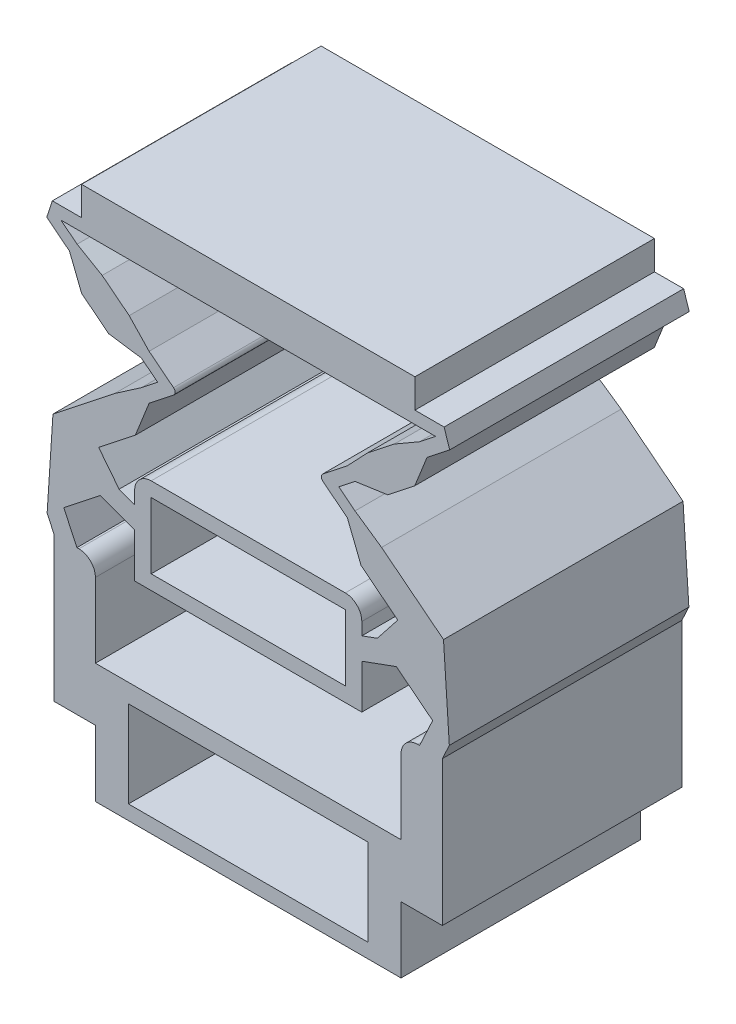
ISO-10303-21;
HEADER;
FILE_DESCRIPTION(('STEP AP214'),'2;1');
FILE_NAME('part.step','',(''),(''),'','','');
FILE_SCHEMA(('AUTOMOTIVE_DESIGN { 1 0 10303 214 1 1 1 1 }'));
ENDSEC;
DATA;
#1=APPLICATION_CONTEXT('core data for automotive mechanical design processes');
#2=APPLICATION_PROTOCOL_DEFINITION('international standard','automotive_design',2000,#1);
#3=PRODUCT_CONTEXT('',#1,'mechanical');
#4=PRODUCT('Part','Part','',(#3));
#5=PRODUCT_RELATED_PRODUCT_CATEGORY('part','',(#4));
#6=PRODUCT_DEFINITION_FORMATION('','',#4);
#7=PRODUCT_DEFINITION_CONTEXT('part definition',#1,'design');
#8=PRODUCT_DEFINITION('design','',#6,#7);
#9=PRODUCT_DEFINITION_SHAPE('','',#8);
#10=(LENGTH_UNIT() NAMED_UNIT(*) SI_UNIT(.MILLI.,.METRE.));
#11=(NAMED_UNIT(*) PLANE_ANGLE_UNIT() SI_UNIT($,.RADIAN.));
#12=(NAMED_UNIT(*) SI_UNIT($,.STERADIAN.) SOLID_ANGLE_UNIT());
#13=UNCERTAINTY_MEASURE_WITH_UNIT(LENGTH_MEASURE(1.E-05),#10,'distance_accuracy_value','');
#14=(GEOMETRIC_REPRESENTATION_CONTEXT(3) GLOBAL_UNCERTAINTY_ASSIGNED_CONTEXT((#13)) GLOBAL_UNIT_ASSIGNED_CONTEXT((#10,
#11,#12)) REPRESENTATION_CONTEXT('',''));
#15=CARTESIAN_POINT('',(0.,0.,0.));
#16=DIRECTION('',(0.,0.,1.));
#17=DIRECTION('',(1.,0.,0.));
#18=AXIS2_PLACEMENT_3D('',#15,#16,#17);
#19=CARTESIAN_POINT('',(3.7,1.4,5.8));
#20=DIRECTION('',(1.,0.,0.));
#21=DIRECTION('',(0.,0.,-1.));
#22=AXIS2_PLACEMENT_3D('',#19,#20,#21);
#23=PLANE('',#22);
#24=DIRECTION('',(0.,-1.,0.));
#25=VECTOR('',#24,1.);
#26=CARTESIAN_POINT('',(3.7,1.4,5.8));
#27=LINE('',#26,#25);
#28=CARTESIAN_POINT('',(3.7,3.2,5.8));
#29=VERTEX_POINT('',#28);
#30=CARTESIAN_POINT('',(3.7,1.4,5.8));
#31=VERTEX_POINT('',#30);
#32=EDGE_CURVE('E968',#29,#31,#27,.T.);
#33=ORIENTED_EDGE('',*,*,#32,.F.);
#34=DIRECTION('',(0.,0.,-1.));
#35=VECTOR('',#34,1.);
#36=CARTESIAN_POINT('',(3.7,3.2,5.8));
#37=LINE('',#36,#35);
#38=CARTESIAN_POINT('',(3.7,3.2,0.));
#39=VERTEX_POINT('',#38);
#40=EDGE_CURVE('E1101',#29,#39,#37,.T.);
#41=ORIENTED_EDGE('',*,*,#40,.T.);
#42=DIRECTION('',(0.,-1.,0.));
#43=VECTOR('',#42,1.);
#44=CARTESIAN_POINT('',(3.7,1.4,0.));
#45=LINE('',#44,#43);
#46=CARTESIAN_POINT('',(3.7,1.4,0.));
#47=VERTEX_POINT('',#46);
#48=EDGE_CURVE('E967',#39,#47,#45,.T.);
#49=ORIENTED_EDGE('',*,*,#48,.T.);
#50=DIRECTION('',(0.,0.,-1.));
#51=VECTOR('',#50,1.);
#52=CARTESIAN_POINT('',(3.7,1.4,5.8));
#53=LINE('',#52,#51);
#54=EDGE_CURVE('E1078',#31,#47,#53,.T.);
#55=ORIENTED_EDGE('',*,*,#54,.F.);
#56=EDGE_LOOP('',(#33,#41,#49,#55));
#57=FACE_BOUND('',#56,.T.);
#58=ADVANCED_FACE('F38',(#57),#23,.F.);
#59=CARTESIAN_POINT('',(-3.7,1.4,5.8));
#60=DIRECTION('',(0.,-1.,0.));
#61=DIRECTION('',(1.,0.,0.));
#62=AXIS2_PLACEMENT_3D('',#59,#60,#61);
#63=PLANE('',#62);
#64=DIRECTION('',(-1.,0.,0.));
#65=VECTOR('',#64,1.);
#66=CARTESIAN_POINT('',(-3.7,1.4,0.));
#67=LINE('',#66,#65);
#68=CARTESIAN_POINT('',(-3.7,1.4,0.));
#69=VERTEX_POINT('',#68);
#70=EDGE_CURVE('E1006',#47,#69,#67,.T.);
#71=ORIENTED_EDGE('',*,*,#70,.T.);
#72=DIRECTION('',(0.,0.,-1.));
#73=VECTOR('',#72,1.);
#74=CARTESIAN_POINT('',(-3.7,1.4,5.8));
#75=LINE('',#74,#73);
#76=CARTESIAN_POINT('',(-3.7,1.4,5.8));
#77=VERTEX_POINT('',#76);
#78=EDGE_CURVE('E1075',#77,#69,#75,.T.);
#79=ORIENTED_EDGE('',*,*,#78,.F.);
#80=DIRECTION('',(-1.,0.,0.));
#81=VECTOR('',#80,1.);
#82=CARTESIAN_POINT('',(-3.7,1.4,5.8));
#83=LINE('',#82,#81);
#84=EDGE_CURVE('E970',#31,#77,#83,.T.);
#85=ORIENTED_EDGE('',*,*,#84,.F.);
#86=ORIENTED_EDGE('',*,*,#54,.T.);
#87=EDGE_LOOP('',(#71,#79,#85,#86));
#88=FACE_BOUND('',#87,.T.);
#89=ADVANCED_FACE('F1396',(#88),#63,.F.);
#90=CARTESIAN_POINT('',(-3.7,-1.4,5.8));
#91=DIRECTION('',(1.,0.,0.));
#92=DIRECTION('',(0.,0.,-1.));
#93=AXIS2_PLACEMENT_3D('',#90,#91,#92);
#94=PLANE('',#93);
#95=DIRECTION('',(0.,-1.,0.));
#96=VECTOR('',#95,1.);
#97=CARTESIAN_POINT('',(-3.7,-1.4,5.8));
#98=LINE('',#97,#96);
#99=CARTESIAN_POINT('',(-3.7,0.100000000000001,5.8));
#100=VERTEX_POINT('',#99);
#101=CARTESIAN_POINT('',(-3.7,-1.5,5.8));
#102=VERTEX_POINT('',#101);
#103=EDGE_CURVE('E974',#100,#102,#98,.T.);
#104=ORIENTED_EDGE('',*,*,#103,.F.);
#105=DIRECTION('',(0.,0.,-1.));
#106=VECTOR('',#105,1.);
#107=CARTESIAN_POINT('',(-3.7,0.100000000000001,5.8));
#108=LINE('',#107,#106);
#109=CARTESIAN_POINT('',(-3.7,0.100000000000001,0.));
#110=VERTEX_POINT('',#109);
#111=EDGE_CURVE('E919',#100,#110,#108,.T.);
#112=ORIENTED_EDGE('',*,*,#111,.T.);
#113=DIRECTION('',(0.,-1.,0.));
#114=VECTOR('',#113,1.);
#115=CARTESIAN_POINT('',(-3.7,-1.4,0.));
#116=LINE('',#115,#114);
#117=CARTESIAN_POINT('',(-3.7,-1.5,0.));
#118=VERTEX_POINT('',#117);
#119=EDGE_CURVE('E1009',#110,#118,#116,.T.);
#120=ORIENTED_EDGE('',*,*,#119,.T.);
#121=DIRECTION('',(0.,0.,1.));
#122=VECTOR('',#121,1.);
#123=CARTESIAN_POINT('',(-3.7,-1.5,-7.40067564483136));
#124=LINE('',#123,#122);
#125=EDGE_CURVE('E812',#118,#102,#124,.T.);
#126=ORIENTED_EDGE('',*,*,#125,.T.);
#127=EDGE_LOOP('',(#104,#112,#120,#126));
#128=FACE_BOUND('',#127,.T.);
#129=ADVANCED_FACE('F1275',(#128),#94,.F.);
#130=CARTESIAN_POINT('',(3.7,-1.4,5.8));
#131=DIRECTION('',(-1.,0.,0.));
#132=DIRECTION('',(0.,0.,1.));
#133=AXIS2_PLACEMENT_3D('',#130,#131,#132);
#134=PLANE('',#133);
#135=DIRECTION('',(0.,1.,0.));
#136=VECTOR('',#135,1.);
#137=CARTESIAN_POINT('',(3.7,-1.4,0.));
#138=LINE('',#137,#136);
#139=CARTESIAN_POINT('',(3.7,-1.5,0.));
#140=VERTEX_POINT('',#139);
#141=CARTESIAN_POINT('',(3.7,0.100000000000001,0.));
#142=VERTEX_POINT('',#141);
#143=EDGE_CURVE('E1011',#140,#142,#138,.T.);
#144=ORIENTED_EDGE('',*,*,#143,.T.);
#145=DIRECTION('',(0.,0.,-1.));
#146=VECTOR('',#145,1.);
#147=CARTESIAN_POINT('',(3.7,0.100000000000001,5.8));
#148=LINE('',#147,#146);
#149=CARTESIAN_POINT('',(3.7,0.100000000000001,5.8));
#150=VERTEX_POINT('',#149);
#151=EDGE_CURVE('E1072',#150,#142,#148,.T.);
#152=ORIENTED_EDGE('',*,*,#151,.F.);
#153=DIRECTION('',(0.,1.,0.));
#154=VECTOR('',#153,1.);
#155=CARTESIAN_POINT('',(3.7,-1.4,5.8));
#156=LINE('',#155,#154);
#157=CARTESIAN_POINT('',(3.7,-1.5,5.8));
#158=VERTEX_POINT('',#157);
#159=EDGE_CURVE('E976',#158,#150,#156,.T.);
#160=ORIENTED_EDGE('',*,*,#159,.F.);
#161=DIRECTION('',(0.,0.,1.));
#162=VECTOR('',#161,1.);
#163=CARTESIAN_POINT('',(3.7,-1.5,-7.40067564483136));
#164=LINE('',#163,#162);
#165=EDGE_CURVE('E809',#140,#158,#164,.T.);
#166=ORIENTED_EDGE('',*,*,#165,.F.);
#167=EDGE_LOOP('',(#144,#152,#160,#166));
#168=FACE_BOUND('',#167,.T.);
#169=ADVANCED_FACE('F1284',(#168),#134,.F.);
#170=CARTESIAN_POINT('',(3.7,0.100000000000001,5.8));
#171=DIRECTION('',(0.,1.,0.));
#172=DIRECTION('',(0.,0.,1.));
#173=AXIS2_PLACEMENT_3D('',#170,#171,#172);
#174=PLANE('',#173);
#175=DIRECTION('',(1.,0.,0.));
#176=VECTOR('',#175,1.);
#177=CARTESIAN_POINT('',(3.7,0.100000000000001,0.));
#178=LINE('',#177,#176);
#179=CARTESIAN_POINT('',(4.7,0.100000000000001,0.));
#180=VERTEX_POINT('',#179);
#181=EDGE_CURVE('E1013',#142,#180,#178,.T.);
#182=ORIENTED_EDGE('',*,*,#181,.T.);
#183=DIRECTION('',(0.,0.,-1.));
#184=VECTOR('',#183,1.);
#185=CARTESIAN_POINT('',(4.7,0.100000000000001,5.8));
#186=LINE('',#185,#184);
#187=CARTESIAN_POINT('',(4.7,0.100000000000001,5.8));
#188=VERTEX_POINT('',#187);
#189=EDGE_CURVE('E1069',#188,#180,#186,.T.);
#190=ORIENTED_EDGE('',*,*,#189,.F.);
#191=DIRECTION('',(1.,0.,0.));
#192=VECTOR('',#191,1.);
#193=CARTESIAN_POINT('',(3.7,0.100000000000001,5.8));
#194=LINE('',#193,#192);
#195=EDGE_CURVE('E978',#150,#188,#194,.T.);
#196=ORIENTED_EDGE('',*,*,#195,.F.);
#197=ORIENTED_EDGE('',*,*,#151,.T.);
#198=EDGE_LOOP('',(#182,#190,#196,#197));
#199=FACE_BOUND('',#198,.T.);
#200=ADVANCED_FACE('F1289',(#199),#174,.F.);
#201=CARTESIAN_POINT('',(4.7,3.6,5.8));
#202=DIRECTION('',(-1.,0.,0.));
#203=DIRECTION('',(0.,0.,1.));
#204=AXIS2_PLACEMENT_3D('',#201,#202,#203);
#205=PLANE('',#204);
#206=DIRECTION('',(0.,1.,0.));
#207=VECTOR('',#206,1.);
#208=CARTESIAN_POINT('',(4.7,3.6,0.));
#209=LINE('',#208,#207);
#210=CARTESIAN_POINT('',(4.7,3.6,0.));
#211=VERTEX_POINT('',#210);
#212=EDGE_CURVE('E1015',#180,#211,#209,.T.);
#213=ORIENTED_EDGE('',*,*,#212,.T.);
#214=DIRECTION('',(0.,0.,-1.));
#215=VECTOR('',#214,1.);
#216=CARTESIAN_POINT('',(4.7,3.6,5.8));
#217=LINE('',#216,#215);
#218=CARTESIAN_POINT('',(4.7,3.6,5.8));
#219=VERTEX_POINT('',#218);
#220=EDGE_CURVE('E1066',#219,#211,#217,.T.);
#221=ORIENTED_EDGE('',*,*,#220,.F.);
#222=DIRECTION('',(0.,1.,0.));
#223=VECTOR('',#222,1.);
#224=CARTESIAN_POINT('',(4.7,3.6,5.8));
#225=LINE('',#224,#223);
#226=EDGE_CURVE('E980',#188,#219,#225,.T.);
#227=ORIENTED_EDGE('',*,*,#226,.F.);
#228=ORIENTED_EDGE('',*,*,#189,.T.);
#229=EDGE_LOOP('',(#213,#221,#227,#228));
#230=FACE_BOUND('',#229,.T.);
#231=ADVANCED_FACE('F1295',(#230),#205,.F.);
#232=CARTESIAN_POINT('',(4.7,3.6,5.8));
#233=DIRECTION('',(-0.906307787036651,0.422618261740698,0.));
#234=DIRECTION('',(-0.422618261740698,-0.906307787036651,0.));
#235=AXIS2_PLACEMENT_3D('',#232,#233,#234);
#236=PLANE('',#235);
#237=DIRECTION('',(0.422618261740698,0.906307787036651,0.));
#238=VECTOR('',#237,1.);
#239=CARTESIAN_POINT('',(4.7,3.6,0.));
#240=LINE('',#239,#238);
#241=CARTESIAN_POINT('',(4.86904730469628,3.96252311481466,0.));
#242=VERTEX_POINT('',#241);
#243=EDGE_CURVE('E1017',#211,#242,#240,.T.);
#244=ORIENTED_EDGE('',*,*,#243,.T.);
#245=DIRECTION('',(0.,0.,-1.));
#246=VECTOR('',#245,1.);
#247=CARTESIAN_POINT('',(4.86904730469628,3.96252311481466,5.8));
#248=LINE('',#247,#246);
#249=CARTESIAN_POINT('',(4.86904730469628,3.96252311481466,5.8));
#250=VERTEX_POINT('',#249);
#251=EDGE_CURVE('E1064',#250,#242,#248,.T.);
#252=ORIENTED_EDGE('',*,*,#251,.F.);
#253=DIRECTION('',(0.422618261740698,0.906307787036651,0.));
#254=VECTOR('',#253,1.);
#255=CARTESIAN_POINT('',(4.7,3.6,5.8));
#256=LINE('',#255,#254);
#257=EDGE_CURVE('E982',#219,#250,#256,.T.);
#258=ORIENTED_EDGE('',*,*,#257,.F.);
#259=ORIENTED_EDGE('',*,*,#220,.T.);
#260=EDGE_LOOP('',(#244,#252,#258,#259));
#261=FACE_BOUND('',#260,.T.);
#262=ADVANCED_FACE('F1299',(#261),#236,.F.);
#263=CARTESIAN_POINT('',(3.99263981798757,6.43622713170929,5.8));
#264=DIRECTION('',(0.785299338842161,-0.61911626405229,0.));
#265=DIRECTION('',(0.61911626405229,0.785299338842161,0.));
#266=AXIS2_PLACEMENT_3D('',#263,#264,#265);
#267=PLANE('',#266);
#268=DIRECTION('',(-0.61911626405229,-0.785299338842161,0.));
#269=VECTOR('',#268,1.);
#270=CARTESIAN_POINT('',(3.99263981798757,6.43622713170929,5.8));
#271=LINE('',#270,#269);
#272=CARTESIAN_POINT('',(3.62117005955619,5.965047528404,5.8));
#273=VERTEX_POINT('',#272);
#274=CARTESIAN_POINT('',(3.12587704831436,5.33680805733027,5.8));
#275=VERTEX_POINT('',#274);
#276=EDGE_CURVE('E985',#273,#275,#271,.T.);
#277=ORIENTED_EDGE('',*,*,#276,.F.);
#278=DIRECTION('',(0.,0.,1.));
#279=VECTOR('',#278,1.);
#280=CARTESIAN_POINT('',(3.62117005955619,5.965047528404,-11.167266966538));
#281=LINE('',#280,#279);
#282=CARTESIAN_POINT('',(3.62117005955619,5.965047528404,0.));
#283=VERTEX_POINT('',#282);
#284=EDGE_CURVE('E697',#283,#273,#281,.T.);
#285=ORIENTED_EDGE('',*,*,#284,.F.);
#286=DIRECTION('',(-0.61911626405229,-0.785299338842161,0.));
#287=VECTOR('',#286,1.);
#288=CARTESIAN_POINT('',(3.99263981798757,6.43622713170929,0.));
#289=LINE('',#288,#287);
#290=CARTESIAN_POINT('',(3.12587704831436,5.33680805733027,0.));
#291=VERTEX_POINT('',#290);
#292=EDGE_CURVE('E1020',#283,#291,#289,.T.);
#293=ORIENTED_EDGE('',*,*,#292,.T.);
#294=DIRECTION('',(0.,0.,-1.));
#295=VECTOR('',#294,1.);
#296=CARTESIAN_POINT('',(3.12587704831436,5.33680805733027,5.8));
#297=LINE('',#296,#295);
#298=EDGE_CURVE('E1061',#275,#291,#297,.T.);
#299=ORIENTED_EDGE('',*,*,#298,.F.);
#300=EDGE_LOOP('',(#277,#285,#293,#299));
#301=FACE_BOUND('',#300,.T.);
#302=ADVANCED_FACE('F1489',(#301),#267,.F.);
#303=CARTESIAN_POINT('',(2.75,5.2,5.8));
#304=DIRECTION('',(0.342020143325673,-0.939692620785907,0.));
#305=DIRECTION('',(0.939692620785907,0.342020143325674,0.));
#306=AXIS2_PLACEMENT_3D('',#303,#304,#305);
#307=PLANE('',#306);
#308=DIRECTION('',(-0.939692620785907,-0.342020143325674,0.));
#309=VECTOR('',#308,1.);
#310=CARTESIAN_POINT('',(2.75,5.2,0.));
#311=LINE('',#310,#309);
#312=CARTESIAN_POINT('',(2.75,5.2,0.));
#313=VERTEX_POINT('',#312);
#314=EDGE_CURVE('E1022',#291,#313,#311,.T.);
#315=ORIENTED_EDGE('',*,*,#314,.T.);
#316=DIRECTION('',(0.,0.,-1.));
#317=VECTOR('',#316,1.);
#318=CARTESIAN_POINT('',(2.75,5.2,5.8));
#319=LINE('',#318,#317);
#320=CARTESIAN_POINT('',(2.75,5.2,5.8));
#321=VERTEX_POINT('',#320);
#322=EDGE_CURVE('E1058',#321,#313,#319,.T.);
#323=ORIENTED_EDGE('',*,*,#322,.F.);
#324=DIRECTION('',(-0.939692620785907,-0.342020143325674,0.));
#325=VECTOR('',#324,1.);
#326=CARTESIAN_POINT('',(2.75,5.2,5.8));
#327=LINE('',#326,#325);
#328=EDGE_CURVE('E987',#275,#321,#327,.T.);
#329=ORIENTED_EDGE('',*,*,#328,.F.);
#330=ORIENTED_EDGE('',*,*,#298,.T.);
#331=EDGE_LOOP('',(#315,#323,#329,#330));
#332=FACE_BOUND('',#331,.T.);
#333=ADVANCED_FACE('F1495',(#332),#307,.F.);
#334=CARTESIAN_POINT('',(-2.75,5.2,5.8));
#335=DIRECTION('',(1.,0.,0.));
#336=DIRECTION('',(0.,1.,0.));
#337=AXIS2_PLACEMENT_3D('',#334,#335,#336);
#338=PLANE('',#337);
#339=DIRECTION('',(0.,-1.,0.));
#340=VECTOR('',#339,1.);
#341=CARTESIAN_POINT('',(-2.75,5.2,5.8));
#342=LINE('',#341,#340);
#343=CARTESIAN_POINT('',(-2.75,4.66791111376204,5.8));
#344=VERTEX_POINT('',#343);
#345=CARTESIAN_POINT('',(-2.75,3.6,5.8));
#346=VERTEX_POINT('',#345);
#347=EDGE_CURVE('E989',#344,#346,#342,.T.);
#348=ORIENTED_EDGE('',*,*,#347,.F.);
#349=DIRECTION('',(0.,0.,-1.));
#350=VECTOR('',#349,1.);
#351=CARTESIAN_POINT('',(-2.75,4.66791111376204,5.8));
#352=LINE('',#351,#350);
#353=CARTESIAN_POINT('',(-2.75,4.66791111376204,0.));
#354=VERTEX_POINT('',#353);
#355=EDGE_CURVE('E958',#344,#354,#352,.T.);
#356=ORIENTED_EDGE('',*,*,#355,.T.);
#357=DIRECTION('',(0.,-1.,0.));
#358=VECTOR('',#357,1.);
#359=CARTESIAN_POINT('',(-2.75,5.2,0.));
#360=LINE('',#359,#358);
#361=CARTESIAN_POINT('',(-2.75,3.6,0.));
#362=VERTEX_POINT('',#361);
#363=EDGE_CURVE('E1024',#354,#362,#360,.T.);
#364=ORIENTED_EDGE('',*,*,#363,.T.);
#365=DIRECTION('',(0.,0.,-1.));
#366=VECTOR('',#365,1.);
#367=CARTESIAN_POINT('',(-2.75,3.6,5.8));
#368=LINE('',#367,#366);
#369=EDGE_CURVE('E1052',#346,#362,#368,.T.);
#370=ORIENTED_EDGE('',*,*,#369,.F.);
#371=EDGE_LOOP('',(#348,#356,#364,#370));
#372=FACE_BOUND('',#371,.T.);
#373=ADVANCED_FACE('F1579',(#372),#338,.F.);
#374=CARTESIAN_POINT('',(-2.75,3.6,5.8));
#375=DIRECTION('',(0.,1.,0.));
#376=DIRECTION('',(0.,0.,1.));
#377=AXIS2_PLACEMENT_3D('',#374,#375,#376);
#378=PLANE('',#377);
#379=DIRECTION('',(1.,0.,0.));
#380=VECTOR('',#379,1.);
#381=CARTESIAN_POINT('',(-2.75,3.6,0.));
#382=LINE('',#381,#380);
#383=CARTESIAN_POINT('',(2.75,3.6,0.));
#384=VERTEX_POINT('',#383);
#385=EDGE_CURVE('E1026',#362,#384,#382,.T.);
#386=ORIENTED_EDGE('',*,*,#385,.T.);
#387=DIRECTION('',(0.,0.,-1.));
#388=VECTOR('',#387,1.);
#389=CARTESIAN_POINT('',(2.75,3.6,5.8));
#390=LINE('',#389,#388);
#391=CARTESIAN_POINT('',(2.75,3.6,5.8));
#392=VERTEX_POINT('',#391);
#393=EDGE_CURVE('E1049',#392,#384,#390,.T.);
#394=ORIENTED_EDGE('',*,*,#393,.F.);
#395=DIRECTION('',(1.,0.,0.));
#396=VECTOR('',#395,1.);
#397=CARTESIAN_POINT('',(-2.75,3.6,5.8));
#398=LINE('',#397,#396);
#399=EDGE_CURVE('E991',#346,#392,#398,.T.);
#400=ORIENTED_EDGE('',*,*,#399,.F.);
#401=ORIENTED_EDGE('',*,*,#369,.T.);
#402=EDGE_LOOP('',(#386,#394,#400,#401));
#403=FACE_BOUND('',#402,.T.);
#404=ADVANCED_FACE('F1575',(#403),#378,.F.);
#405=CARTESIAN_POINT('',(2.75,4.66791111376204,5.8));
#406=DIRECTION('',(-1.,0.,0.));
#407=DIRECTION('',(0.,0.,1.));
#408=AXIS2_PLACEMENT_3D('',#405,#406,#407);
#409=PLANE('',#408);
#410=DIRECTION('',(0.,1.,0.));
#411=VECTOR('',#410,1.);
#412=CARTESIAN_POINT('',(2.75,4.66791111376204,0.));
#413=LINE('',#412,#411);
#414=CARTESIAN_POINT('',(2.75,4.66791111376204,0.));
#415=VERTEX_POINT('',#414);
#416=EDGE_CURVE('E1028',#384,#415,#413,.T.);
#417=ORIENTED_EDGE('',*,*,#416,.T.);
#418=DIRECTION('',(0.,0.,-1.));
#419=VECTOR('',#418,1.);
#420=CARTESIAN_POINT('',(2.75,4.66791111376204,5.8));
#421=LINE('',#420,#419);
#422=CARTESIAN_POINT('',(2.75,4.66791111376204,5.8));
#423=VERTEX_POINT('',#422);
#424=EDGE_CURVE('E1046',#423,#415,#421,.T.);
#425=ORIENTED_EDGE('',*,*,#424,.F.);
#426=DIRECTION('',(0.,1.,0.));
#427=VECTOR('',#426,1.);
#428=CARTESIAN_POINT('',(2.75,4.66791111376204,5.8));
#429=LINE('',#428,#427);
#430=EDGE_CURVE('E993',#392,#423,#429,.T.);
#431=ORIENTED_EDGE('',*,*,#430,.F.);
#432=ORIENTED_EDGE('',*,*,#393,.T.);
#433=EDGE_LOOP('',(#417,#425,#431,#432));
#434=FACE_BOUND('',#433,.T.);
#435=ADVANCED_FACE('F1571',(#434),#409,.F.);
#436=CARTESIAN_POINT('',(2.75,4.66791111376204,5.8));
#437=DIRECTION('',(-0.342020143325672,0.939692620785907,0.));
#438=DIRECTION('',(-0.939692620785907,-0.342020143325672,0.));
#439=AXIS2_PLACEMENT_3D('',#436,#437,#438);
#440=PLANE('',#439);
#441=DIRECTION('',(0.939692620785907,0.342020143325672,0.));
#442=VECTOR('',#441,1.);
#443=CARTESIAN_POINT('',(2.75,4.66791111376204,0.));
#444=LINE('',#443,#442);
#445=CARTESIAN_POINT('',(3.58761837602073,4.97277927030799,0.));
#446=VERTEX_POINT('',#445);
#447=EDGE_CURVE('E1030',#415,#446,#444,.T.);
#448=ORIENTED_EDGE('',*,*,#447,.T.);
#449=DIRECTION('',(0.,0.,-1.));
#450=VECTOR('',#449,1.);
#451=CARTESIAN_POINT('',(3.58761837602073,4.97277927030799,5.8));
#452=LINE('',#451,#450);
#453=CARTESIAN_POINT('',(3.58761837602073,4.97277927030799,5.8));
#454=VERTEX_POINT('',#453);
#455=EDGE_CURVE('E1043',#454,#446,#452,.T.);
#456=ORIENTED_EDGE('',*,*,#455,.F.);
#457=DIRECTION('',(0.939692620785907,0.342020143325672,0.));
#458=VECTOR('',#457,1.);
#459=CARTESIAN_POINT('',(2.75,4.66791111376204,5.8));
#460=LINE('',#459,#458);
#461=EDGE_CURVE('E995',#423,#454,#460,.T.);
#462=ORIENTED_EDGE('',*,*,#461,.F.);
#463=ORIENTED_EDGE('',*,*,#424,.T.);
#464=EDGE_LOOP('',(#448,#456,#462,#463));
#465=FACE_BOUND('',#464,.T.);
#466=ADVANCED_FACE('F1567',(#465),#440,.F.);
#467=CARTESIAN_POINT('',(3.58761837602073,4.97277927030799,5.8));
#468=DIRECTION('',(0.61911626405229,0.785299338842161,0.));
#469=DIRECTION('',(-0.785299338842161,0.61911626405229,0.));
#470=AXIS2_PLACEMENT_3D('',#467,#468,#469);
#471=PLANE('',#470);
#472=DIRECTION('',(0.785299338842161,-0.61911626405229,0.));
#473=VECTOR('',#472,1.);
#474=CARTESIAN_POINT('',(3.58761837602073,4.97277927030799,0.));
#475=LINE('',#474,#473);
#476=CARTESIAN_POINT('',(4.46565644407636,4.28054941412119,0.));
#477=VERTEX_POINT('',#476);
#478=EDGE_CURVE('E1032',#446,#477,#475,.T.);
#479=ORIENTED_EDGE('',*,*,#478,.T.);
#480=DIRECTION('',(0.,0.,-1.));
#481=VECTOR('',#480,1.);
#482=CARTESIAN_POINT('',(4.46565644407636,4.28054941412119,5.8));
#483=LINE('',#482,#481);
#484=CARTESIAN_POINT('',(4.46565644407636,4.28054941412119,5.8));
#485=VERTEX_POINT('',#484);
#486=EDGE_CURVE('E1040',#485,#477,#483,.T.);
#487=ORIENTED_EDGE('',*,*,#486,.F.);
#488=DIRECTION('',(0.785299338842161,-0.61911626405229,0.));
#489=VECTOR('',#488,1.);
#490=CARTESIAN_POINT('',(3.58761837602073,4.97277927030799,5.8));
#491=LINE('',#490,#489);
#492=EDGE_CURVE('E997',#454,#485,#491,.T.);
#493=ORIENTED_EDGE('',*,*,#492,.F.);
#494=ORIENTED_EDGE('',*,*,#455,.T.);
#495=EDGE_LOOP('',(#479,#487,#493,#494));
#496=FACE_BOUND('',#495,.T.);
#497=ADVANCED_FACE('F1563',(#496),#471,.F.);
#498=CARTESIAN_POINT('',(4.14831104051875,3.6,5.8));
#499=DIRECTION('',(0.906307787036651,-0.422618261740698,0.));
#500=DIRECTION('',(0.422618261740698,0.906307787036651,0.));
#501=AXIS2_PLACEMENT_3D('',#498,#499,#500);
#502=PLANE('',#501);
#503=DIRECTION('',(-0.422618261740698,-0.906307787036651,0.));
#504=VECTOR('',#503,1.);
#505=CARTESIAN_POINT('',(4.14831104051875,3.6,0.));
#506=LINE('',#505,#504);
#507=CARTESIAN_POINT('',(4.14831104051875,3.6,0.));
#508=VERTEX_POINT('',#507);
#509=EDGE_CURVE('E1034',#477,#508,#506,.T.);
#510=ORIENTED_EDGE('',*,*,#509,.T.);
#511=DIRECTION('',(0.,0.,-1.));
#512=VECTOR('',#511,1.);
#513=CARTESIAN_POINT('',(4.14831104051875,3.6,5.8));
#514=LINE('',#513,#512);
#515=CARTESIAN_POINT('',(4.14831104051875,3.6,5.8));
#516=VERTEX_POINT('',#515);
#517=EDGE_CURVE('E1004',#516,#508,#514,.T.);
#518=ORIENTED_EDGE('',*,*,#517,.F.);
#519=DIRECTION('',(-0.422618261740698,-0.906307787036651,0.));
#520=VECTOR('',#519,1.);
#521=CARTESIAN_POINT('',(4.14831104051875,3.6,5.8));
#522=LINE('',#521,#520);
#523=EDGE_CURVE('E999',#485,#516,#522,.T.);
#524=ORIENTED_EDGE('',*,*,#523,.F.);
#525=ORIENTED_EDGE('',*,*,#486,.T.);
#526=EDGE_LOOP('',(#510,#518,#524,#525));
#527=FACE_BOUND('',#526,.T.);
#528=ADVANCED_FACE('F1559',(#527),#502,.F.);
#529=CARTESIAN_POINT('',(3.7,3.6,5.8));
#530=DIRECTION('',(0.,-1.,0.));
#531=DIRECTION('',(0.,0.,-1.));
#532=AXIS2_PLACEMENT_3D('',#529,#530,#531);
#533=PLANE('',#532);
#534=DIRECTION('',(-1.,0.,0.));
#535=VECTOR('',#534,1.);
#536=CARTESIAN_POINT('',(3.7,3.6,0.));
#537=LINE('',#536,#535);
#538=CARTESIAN_POINT('',(4.1,3.6,0.));
#539=VERTEX_POINT('',#538);
#540=EDGE_CURVE('E971',#508,#539,#537,.T.);
#541=ORIENTED_EDGE('',*,*,#540,.T.);
#542=DIRECTION('',(0.,0.,-1.));
#543=VECTOR('',#542,1.);
#544=CARTESIAN_POINT('',(4.1,3.6,5.8));
#545=LINE('',#544,#543);
#546=CARTESIAN_POINT('',(4.1,3.6,5.8));
#547=VERTEX_POINT('',#546);
#548=EDGE_CURVE('E1108',#539,#547,#545,.F.);
#549=ORIENTED_EDGE('',*,*,#548,.T.);
#550=DIRECTION('',(-1.,0.,0.));
#551=VECTOR('',#550,1.);
#552=CARTESIAN_POINT('',(3.7,3.6,5.8));
#553=LINE('',#552,#551);
#554=EDGE_CURVE('E1001',#516,#547,#553,.T.);
#555=ORIENTED_EDGE('',*,*,#554,.F.);
#556=ORIENTED_EDGE('',*,*,#517,.T.);
#557=EDGE_LOOP('',(#541,#549,#555,#556));
#558=FACE_BOUND('',#557,.T.);
#559=ADVANCED_FACE('F1554',(#558),#533,.F.);
#560=CARTESIAN_POINT('',(0.,0.,5.8));
#561=DIRECTION('',(0.,0.,-1.));
#562=DIRECTION('',(-1.,0.,0.));
#563=AXIS2_PLACEMENT_3D('',#560,#561,#562);
#564=PLANE('',#563);
#565=DIRECTION('',(-0.78529933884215,-0.619116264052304,0.));
#566=VECTOR('',#565,1.);
#567=CARTESIAN_POINT('',(1.70858071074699,8.04592941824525,5.8));
#568=LINE('',#567,#566);
#569=CARTESIAN_POINT('',(2.40005715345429,8.59107735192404,5.8));
#570=VERTEX_POINT('',#569);
#571=CARTESIAN_POINT('',(1.80818963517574,8.12445935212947,5.8));
#572=VERTEX_POINT('',#571);
#573=EDGE_CURVE('E1173',#570,#572,#568,.T.);
#574=ORIENTED_EDGE('',*,*,#573,.T.);
#575=CARTESIAN_POINT('',(1.87010126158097,8.04592941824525,5.8));
#576=DIRECTION('',(0.,0.,-1.));
#577=DIRECTION('',(-1.,0.,0.));
#578=AXIS2_PLACEMENT_3D('',#575,#576,#577);
#579=CIRCLE('',#578,0.1);
#580=CARTESIAN_POINT('',(1.80818963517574,7.96739948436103,5.8));
#581=VERTEX_POINT('',#580);
#582=EDGE_CURVE('E1124',#572,#581,#579,.F.);
#583=ORIENTED_EDGE('',*,*,#582,.T.);
#584=DIRECTION('',(0.785299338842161,-0.61911626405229,0.));
#585=VECTOR('',#584,1.);
#586=CARTESIAN_POINT('',(2.40005715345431,7.50078148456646,5.8));
#587=LINE('',#586,#585);
#588=CARTESIAN_POINT('',(2.40005715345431,7.50078148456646,5.8));
#589=VERTEX_POINT('',#588);
#590=EDGE_CURVE('E1175',#581,#589,#587,.T.);
#591=ORIENTED_EDGE('',*,*,#590,.T.);
#592=DIRECTION('',(0.370531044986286,-0.92882008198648,0.));
#593=VECTOR('',#592,1.);
#594=CARTESIAN_POINT('',(2.73353509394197,6.66484341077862,5.8));
#595=LINE('',#594,#593);
#596=CARTESIAN_POINT('',(2.73353509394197,6.66484341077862,5.8));
#597=VERTEX_POINT('',#596);
#598=EDGE_CURVE('E1177',#589,#597,#595,.T.);
#599=ORIENTED_EDGE('',*,*,#598,.T.);
#600=DIRECTION('',(0.785299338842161,-0.61911626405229,0.));
#601=VECTOR('',#600,1.);
#602=CARTESIAN_POINT('',(3.62117005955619,5.965047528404,5.8));
#603=LINE('',#602,#601);
#604=EDGE_CURVE('E1180',#597,#273,#603,.T.);
#605=ORIENTED_EDGE('',*,*,#604,.T.);
#606=ORIENTED_EDGE('',*,*,#276,.T.);
#607=ORIENTED_EDGE('',*,*,#328,.T.);
#608=DIRECTION('',(0.,1.,0.));
#609=VECTOR('',#608,1.);
#610=CARTESIAN_POINT('',(2.75,5.9,5.8));
#611=LINE('',#610,#609);
#612=CARTESIAN_POINT('',(2.75,5.5,5.8));
#613=VERTEX_POINT('',#612);
#614=EDGE_CURVE('E842',#321,#613,#611,.T.);
#615=ORIENTED_EDGE('',*,*,#614,.T.);
#616=CARTESIAN_POINT('',(2.35,5.5,5.8));
#617=DIRECTION('',(0.,0.,-1.));
#618=DIRECTION('',(-1.,0.,0.));
#619=AXIS2_PLACEMENT_3D('',#616,#617,#618);
#620=CIRCLE('',#619,0.4);
#621=CARTESIAN_POINT('',(2.35,5.9,5.8));
#622=VERTEX_POINT('',#621);
#623=EDGE_CURVE('E1088',#613,#622,#620,.F.);
#624=ORIENTED_EDGE('',*,*,#623,.T.);
#625=DIRECTION('',(-1.,0.,0.));
#626=VECTOR('',#625,1.);
#627=CARTESIAN_POINT('',(-2.75,5.9,5.8));
#628=LINE('',#627,#626);
#629=CARTESIAN_POINT('',(-2.35,5.9,5.8));
#630=VERTEX_POINT('',#629);
#631=EDGE_CURVE('E839',#622,#630,#628,.T.);
#632=ORIENTED_EDGE('',*,*,#631,.T.);
#633=CARTESIAN_POINT('',(-2.35,5.5,5.8));
#634=DIRECTION('',(0.,0.,-1.));
#635=DIRECTION('',(-1.,0.,0.));
#636=AXIS2_PLACEMENT_3D('',#633,#634,#635);
#637=CIRCLE('',#636,0.4);
#638=CARTESIAN_POINT('',(-2.75,5.5,5.8));
#639=VERTEX_POINT('',#638);
#640=EDGE_CURVE('E1090',#630,#639,#637,.F.);
#641=ORIENTED_EDGE('',*,*,#640,.T.);
#642=DIRECTION('',(0.,-1.,0.));
#643=VECTOR('',#642,1.);
#644=CARTESIAN_POINT('',(-2.75,5.2,5.8));
#645=LINE('',#644,#643);
#646=CARTESIAN_POINT('',(-2.75,5.2,5.8));
#647=VERTEX_POINT('',#646);
#648=EDGE_CURVE('E836',#639,#647,#645,.T.);
#649=ORIENTED_EDGE('',*,*,#648,.T.);
#650=DIRECTION('',(0.939692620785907,-0.342020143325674,0.));
#651=VECTOR('',#650,1.);
#652=CARTESIAN_POINT('',(-2.75,5.2,5.8));
#653=LINE('',#652,#651);
#654=CARTESIAN_POINT('',(-3.12587704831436,5.33680805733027,5.8));
#655=VERTEX_POINT('',#654);
#656=EDGE_CURVE('E905',#655,#647,#653,.T.);
#657=ORIENTED_EDGE('',*,*,#656,.F.);
#658=DIRECTION('',(0.61911626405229,-0.785299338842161,0.));
#659=VECTOR('',#658,1.);
#660=CARTESIAN_POINT('',(-3.99263981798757,6.43622713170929,5.8));
#661=LINE('',#660,#659);
#662=CARTESIAN_POINT('',(-3.62117005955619,5.965047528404,5.8));
#663=VERTEX_POINT('',#662);
#664=EDGE_CURVE('E908',#663,#655,#661,.T.);
#665=ORIENTED_EDGE('',*,*,#664,.F.);
#666=DIRECTION('',(0.785299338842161,0.61911626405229,0.));
#667=VECTOR('',#666,1.);
#668=CARTESIAN_POINT('',(-3.62117005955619,5.965047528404,5.8));
#669=LINE('',#668,#667);
#670=CARTESIAN_POINT('',(-2.73353509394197,6.66484341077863,5.8));
#671=VERTEX_POINT('',#670);
#672=EDGE_CURVE('E600',#663,#671,#669,.T.);
#673=ORIENTED_EDGE('',*,*,#672,.T.);
#674=DIRECTION('',(0.370531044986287,0.928820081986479,0.));
#675=VECTOR('',#674,1.);
#676=CARTESIAN_POINT('',(-2.73353509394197,6.66484341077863,5.8));
#677=LINE('',#676,#675);
#678=CARTESIAN_POINT('',(-2.40005715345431,7.50078148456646,5.8));
#679=VERTEX_POINT('',#678);
#680=EDGE_CURVE('E586',#671,#679,#677,.T.);
#681=ORIENTED_EDGE('',*,*,#680,.T.);
#682=DIRECTION('',(0.785299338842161,0.619116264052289,0.));
#683=VECTOR('',#682,1.);
#684=CARTESIAN_POINT('',(-2.40005715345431,7.50078148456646,5.8));
#685=LINE('',#684,#683);
#686=CARTESIAN_POINT('',(-1.80818963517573,7.96739948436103,5.8));
#687=VERTEX_POINT('',#686);
#688=EDGE_CURVE('E1136',#679,#687,#685,.T.);
#689=ORIENTED_EDGE('',*,*,#688,.T.);
#690=CARTESIAN_POINT('',(-1.87010126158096,8.04592941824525,5.8));
#691=DIRECTION('',(0.,0.,-1.));
#692=DIRECTION('',(-1.,0.,0.));
#693=AXIS2_PLACEMENT_3D('',#690,#691,#692);
#694=CIRCLE('',#693,0.1);
#695=CARTESIAN_POINT('',(-1.80818963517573,8.12445935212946,5.8));
#696=VERTEX_POINT('',#695);
#697=EDGE_CURVE('E1122',#687,#696,#694,.F.);
#698=ORIENTED_EDGE('',*,*,#697,.T.);
#699=DIRECTION('',(-0.785299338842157,0.619116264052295,0.));
#700=VECTOR('',#699,1.);
#701=CARTESIAN_POINT('',(-1.70858071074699,8.04592941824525,5.8));
#702=LINE('',#701,#700);
#703=CARTESIAN_POINT('',(-2.4000571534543,8.59107735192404,5.8));
#704=VERTEX_POINT('',#703);
#705=EDGE_CURVE('E1142',#696,#704,#702,.T.);
#706=ORIENTED_EDGE('',*,*,#705,.T.);
#707=DIRECTION('',(-0.688799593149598,0.724951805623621,0.));
#708=VECTOR('',#707,1.);
#709=CARTESIAN_POINT('',(-2.4000571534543,8.59107735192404,5.8));
#710=LINE('',#709,#708);
#711=CARTESIAN_POINT('',(-2.88221686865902,9.09854361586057,5.8));
#712=VERTEX_POINT('',#711);
#713=EDGE_CURVE('E1144',#704,#712,#710,.T.);
#714=ORIENTED_EDGE('',*,*,#713,.T.);
#715=DIRECTION('',(-0.785299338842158,0.619116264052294,0.));
#716=VECTOR('',#715,1.);
#717=CARTESIAN_POINT('',(-2.88221686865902,9.09854361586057,5.8));
#718=LINE('',#717,#716);
#719=CARTESIAN_POINT('',(-3.5370256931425,9.61478344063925,5.8));
#720=VERTEX_POINT('',#719);
#721=EDGE_CURVE('E1149',#712,#720,#718,.T.);
#722=ORIENTED_EDGE('',*,*,#721,.T.);
#723=DIRECTION('',(-0.865689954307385,0.50058056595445,0.));
#724=VECTOR('',#723,1.);
#725=CARTESIAN_POINT('',(-3.5370256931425,9.61478344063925,5.8));
#726=LINE('',#725,#724);
#727=CARTESIAN_POINT('',(-4.14300866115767,9.96518983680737,5.8));
#728=VERTEX_POINT('',#727);
#729=EDGE_CURVE('E1152',#720,#728,#726,.T.);
#730=ORIENTED_EDGE('',*,*,#729,.T.);
#731=DIRECTION('',(-0.785299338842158,0.619116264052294,0.));
#732=VECTOR('',#731,1.);
#733=CARTESIAN_POINT('',(-4.14300866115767,9.96518983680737,5.8));
#734=LINE('',#733,#732);
#735=CARTESIAN_POINT('',(-4.53565833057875,10.2747479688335,5.8));
#736=VERTEX_POINT('',#735);
#737=EDGE_CURVE('E1155',#728,#736,#734,.T.);
#738=ORIENTED_EDGE('',*,*,#737,.T.);
#739=DIRECTION('',(1.,0.,0.));
#740=VECTOR('',#739,1.);
#741=CARTESIAN_POINT('',(4.53565833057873,10.2747479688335,5.8));
#742=LINE('',#741,#740);
#743=CARTESIAN_POINT('',(4.53565833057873,10.2747479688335,5.8));
#744=VERTEX_POINT('',#743);
#745=EDGE_CURVE('E1158',#736,#744,#742,.T.);
#746=ORIENTED_EDGE('',*,*,#745,.T.);
#747=DIRECTION('',(-0.78529933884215,-0.619116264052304,0.));
#748=VECTOR('',#747,1.);
#749=CARTESIAN_POINT('',(4.14300866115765,9.96518983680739,5.8));
#750=LINE('',#749,#748);
#751=CARTESIAN_POINT('',(4.14300866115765,9.96518983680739,5.8));
#752=VERTEX_POINT('',#751);
#753=EDGE_CURVE('E1161',#744,#752,#750,.T.);
#754=ORIENTED_EDGE('',*,*,#753,.T.);
#755=DIRECTION('',(-0.865689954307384,-0.500580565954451,0.));
#756=VECTOR('',#755,1.);
#757=CARTESIAN_POINT('',(3.53702569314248,9.61478344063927,5.8));
#758=LINE('',#757,#756);
#759=CARTESIAN_POINT('',(3.53702569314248,9.61478344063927,5.8));
#760=VERTEX_POINT('',#759);
#761=EDGE_CURVE('E1164',#752,#760,#758,.T.);
#762=ORIENTED_EDGE('',*,*,#761,.T.);
#763=DIRECTION('',(-0.785299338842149,-0.619116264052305,0.));
#764=VECTOR('',#763,1.);
#765=CARTESIAN_POINT('',(2.882216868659,9.09854361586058,5.8));
#766=LINE('',#765,#764);
#767=CARTESIAN_POINT('',(2.882216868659,9.09854361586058,5.8));
#768=VERTEX_POINT('',#767);
#769=EDGE_CURVE('E1167',#760,#768,#766,.T.);
#770=ORIENTED_EDGE('',*,*,#769,.T.);
#771=DIRECTION('',(-0.688799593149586,-0.724951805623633,0.));
#772=VECTOR('',#771,1.);
#773=CARTESIAN_POINT('',(2.40005715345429,8.59107735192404,5.8));
#774=LINE('',#773,#772);
#775=EDGE_CURVE('E1170',#768,#570,#774,.T.);
#776=ORIENTED_EDGE('',*,*,#775,.T.);
#777=EDGE_LOOP('',(#574,#583,#591,#599,#605,#606,#607,#615,#624,#632,#641,#649,#657,#665,#673,
#681,#689,#698,#706,#714,#722,#730,#738,#746,#754,#762,#770,#776));
#778=FACE_BOUND('',#777,.T.);
#779=DIRECTION('',(0.0653747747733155,-0.99786078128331,0.));
#780=VECTOR('',#779,1.);
#781=CARTESIAN_POINT('',(4.74588869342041,5.84237889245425,5.8));
#782=LINE('',#781,#780);
#783=CARTESIAN_POINT('',(4.72829460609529,6.11092971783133,5.8));
#784=VERTEX_POINT('',#783);
#785=EDGE_CURVE('E826',#784,#250,#782,.T.);
#786=ORIENTED_EDGE('',*,*,#785,.F.);
#787=DIRECTION('',(-0.785299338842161,0.61911626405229,0.));
#788=VECTOR('',#787,1.);
#789=CARTESIAN_POINT('',(4.72829460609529,6.11092971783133,5.8));
#790=LINE('',#789,#788);
#791=CARTESIAN_POINT('',(3.2288281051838,7.29308288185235,5.8));
#792=VERTEX_POINT('',#791);
#793=EDGE_CURVE('E1183',#784,#792,#790,.T.);
#794=ORIENTED_EDGE('',*,*,#793,.T.);
#795=DIRECTION('',(-0.823323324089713,0.567572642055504,0.));
#796=VECTOR('',#795,1.);
#797=CARTESIAN_POINT('',(3.2288281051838,7.29308288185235,5.8));
#798=LINE('',#797,#796);
#799=CARTESIAN_POINT('',(2.58579203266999,7.7363712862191,5.8));
#800=VERTEX_POINT('',#799);
#801=EDGE_CURVE('E1186',#792,#800,#798,.T.);
#802=ORIENTED_EDGE('',*,*,#801,.T.);
#803=DIRECTION('',(-0.78529933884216,0.619116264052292,0.));
#804=VECTOR('',#803,1.);
#805=CARTESIAN_POINT('',(2.58579203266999,7.7363712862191,5.8));
#806=LINE('',#805,#804);
#807=CARTESIAN_POINT('',(2.19314236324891,8.04592941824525,5.8));
#808=VERTEX_POINT('',#807);
#809=EDGE_CURVE('E1189',#800,#808,#806,.T.);
#810=ORIENTED_EDGE('',*,*,#809,.T.);
#811=DIRECTION('',(0.78529933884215,0.619116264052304,0.));
#812=VECTOR('',#811,1.);
#813=CARTESIAN_POINT('',(2.19314236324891,8.04592941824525,5.8));
#814=LINE('',#813,#812);
#815=CARTESIAN_POINT('',(2.58579203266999,8.3554875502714,5.8));
#816=VERTEX_POINT('',#815);
#817=EDGE_CURVE('E1192',#808,#816,#814,.T.);
#818=ORIENTED_EDGE('',*,*,#817,.T.);
#819=DIRECTION('',(0.989647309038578,0.14352074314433,0.));
#820=VECTOR('',#819,1.);
#821=CARTESIAN_POINT('',(2.58579203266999,8.3554875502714,5.8));
#822=LINE('',#821,#820);
#823=CARTESIAN_POINT('',(3.37750987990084,8.47030414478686,5.8));
#824=VERTEX_POINT('',#823);
#825=EDGE_CURVE('E1195',#816,#824,#822,.T.);
#826=ORIENTED_EDGE('',*,*,#825,.T.);
#827=DIRECTION('',(0.785299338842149,0.619116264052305,0.));
#828=VECTOR('',#827,1.);
#829=CARTESIAN_POINT('',(3.37750987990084,8.47030414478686,5.8));
#830=LINE('',#829,#828);
#831=CARTESIAN_POINT('',(4.03231870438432,8.98654396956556,5.8));
#832=VERTEX_POINT('',#831);
#833=EDGE_CURVE('E1198',#824,#832,#830,.T.);
#834=ORIENTED_EDGE('',*,*,#833,.T.);
#835=DIRECTION('',(0.370531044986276,0.928820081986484,0.));
#836=VECTOR('',#835,1.);
#837=CARTESIAN_POINT('',(4.03231870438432,8.98654396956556,5.8));
#838=LINE('',#837,#836);
#839=CARTESIAN_POINT('',(4.32874354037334,9.72960003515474,5.8));
#840=VERTEX_POINT('',#839);
#841=EDGE_CURVE('E1201',#832,#840,#838,.T.);
#842=ORIENTED_EDGE('',*,*,#841,.T.);
#843=DIRECTION('',(0.785299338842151,0.619116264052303,0.));
#844=VECTOR('',#843,1.);
#845=CARTESIAN_POINT('',(4.32874354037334,9.72960003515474,5.8));
#846=LINE('',#845,#844);
#847=CARTESIAN_POINT('',(4.87845307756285,10.1629814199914,5.8));
#848=VERTEX_POINT('',#847);
#849=EDGE_CURVE('E1204',#840,#848,#846,.T.);
#850=ORIENTED_EDGE('',*,*,#849,.T.);
#851=DIRECTION('',(-0.313190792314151,0.949690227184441,0.));
#852=VECTOR('',#851,1.);
#853=CARTESIAN_POINT('',(4.87845307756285,10.1629814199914,5.8));
#854=LINE('',#853,#852);
#855=CARTESIAN_POINT('',(4.74265985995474,10.5747479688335,5.8));
#856=VERTEX_POINT('',#855);
#857=EDGE_CURVE('E1207',#848,#856,#854,.T.);
#858=ORIENTED_EDGE('',*,*,#857,.T.);
#859=DIRECTION('',(-1.,0.,0.));
#860=VECTOR('',#859,1.);
#861=CARTESIAN_POINT('',(4.74265985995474,10.5747479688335,5.8));
#862=LINE('',#861,#860);
#863=CARTESIAN_POINT('',(4.03565833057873,10.5747479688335,5.8));
#864=VERTEX_POINT('',#863);
#865=EDGE_CURVE('E1210',#856,#864,#862,.T.);
#866=ORIENTED_EDGE('',*,*,#865,.T.);
#867=DIRECTION('',(0.,1.,0.));
#868=VECTOR('',#867,1.);
#869=CARTESIAN_POINT('',(4.03565833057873,10.5747479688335,5.8));
#870=LINE('',#869,#868);
#871=CARTESIAN_POINT('',(4.03565833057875,11.2747479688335,5.8));
#872=VERTEX_POINT('',#871);
#873=EDGE_CURVE('E1213',#864,#872,#870,.T.);
#874=ORIENTED_EDGE('',*,*,#873,.T.);
#875=DIRECTION('',(-1.,0.,0.));
#876=VECTOR('',#875,1.);
#877=CARTESIAN_POINT('',(-4.03565833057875,11.2747479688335,5.8));
#878=LINE('',#877,#876);
#879=CARTESIAN_POINT('',(-4.03565833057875,11.2747479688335,5.8));
#880=VERTEX_POINT('',#879);
#881=EDGE_CURVE('E1216',#872,#880,#878,.T.);
#882=ORIENTED_EDGE('',*,*,#881,.T.);
#883=DIRECTION('',(0.,-1.,0.));
#884=VECTOR('',#883,1.);
#885=CARTESIAN_POINT('',(-4.03565833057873,10.5747479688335,5.8));
#886=LINE('',#885,#884);
#887=CARTESIAN_POINT('',(-4.03565833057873,10.5747479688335,5.8));
#888=VERTEX_POINT('',#887);
#889=EDGE_CURVE('E1219',#880,#888,#886,.T.);
#890=ORIENTED_EDGE('',*,*,#889,.T.);
#891=DIRECTION('',(-1.,0.,0.));
#892=VECTOR('',#891,1.);
#893=CARTESIAN_POINT('',(-4.74265985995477,10.5747479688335,5.8));
#894=LINE('',#893,#892);
#895=CARTESIAN_POINT('',(-4.74265985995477,10.5747479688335,5.8));
#896=VERTEX_POINT('',#895);
#897=EDGE_CURVE('E1222',#888,#896,#894,.T.);
#898=ORIENTED_EDGE('',*,*,#897,.T.);
#899=DIRECTION('',(-0.313190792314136,-0.949690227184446,0.));
#900=VECTOR('',#899,1.);
#901=CARTESIAN_POINT('',(-4.87845307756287,10.1629814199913,5.8));
#902=LINE('',#901,#900);
#903=CARTESIAN_POINT('',(-4.87845307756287,10.1629814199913,5.8));
#904=VERTEX_POINT('',#903);
#905=EDGE_CURVE('E1225',#896,#904,#902,.T.);
#906=ORIENTED_EDGE('',*,*,#905,.T.);
#907=DIRECTION('',(0.785299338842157,-0.619116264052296,0.));
#908=VECTOR('',#907,1.);
#909=CARTESIAN_POINT('',(-4.32874354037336,9.72960003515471,5.8));
#910=LINE('',#909,#908);
#911=CARTESIAN_POINT('',(-4.32874354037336,9.72960003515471,5.8));
#912=VERTEX_POINT('',#911);
#913=EDGE_CURVE('E1228',#904,#912,#910,.T.);
#914=ORIENTED_EDGE('',*,*,#913,.T.);
#915=DIRECTION('',(0.370531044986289,-0.928820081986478,0.));
#916=VECTOR('',#915,1.);
#917=CARTESIAN_POINT('',(-4.03231870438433,8.98654396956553,5.8));
#918=LINE('',#917,#916);
#919=CARTESIAN_POINT('',(-4.03231870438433,8.98654396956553,5.8));
#920=VERTEX_POINT('',#919);
#921=EDGE_CURVE('E1231',#912,#920,#918,.T.);
#922=ORIENTED_EDGE('',*,*,#921,.T.);
#923=DIRECTION('',(0.785299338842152,-0.619116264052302,0.));
#924=VECTOR('',#923,1.);
#925=CARTESIAN_POINT('',(-3.37750987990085,8.47030414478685,5.8));
#926=LINE('',#925,#924);
#927=CARTESIAN_POINT('',(-3.37750987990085,8.47030414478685,5.8));
#928=VERTEX_POINT('',#927);
#929=EDGE_CURVE('E1234',#920,#928,#926,.T.);
#930=ORIENTED_EDGE('',*,*,#929,.T.);
#931=DIRECTION('',(0.98964730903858,-0.143520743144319,0.));
#932=VECTOR('',#931,1.);
#933=CARTESIAN_POINT('',(-2.58579203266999,8.35548755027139,5.8));
#934=LINE('',#933,#932);
#935=CARTESIAN_POINT('',(-2.58579203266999,8.35548755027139,5.8));
#936=VERTEX_POINT('',#935);
#937=EDGE_CURVE('E1237',#928,#936,#934,.T.);
#938=ORIENTED_EDGE('',*,*,#937,.T.);
#939=DIRECTION('',(0.785299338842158,-0.619116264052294,0.));
#940=VECTOR('',#939,1.);
#941=CARTESIAN_POINT('',(-2.19314236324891,8.04592941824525,5.8));
#942=LINE('',#941,#940);
#943=CARTESIAN_POINT('',(-2.19314236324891,8.04592941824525,5.8));
#944=VERTEX_POINT('',#943);
#945=EDGE_CURVE('E1240',#936,#944,#942,.T.);
#946=ORIENTED_EDGE('',*,*,#945,.T.);
#947=DIRECTION('',(-0.78529933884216,-0.619116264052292,0.));
#948=VECTOR('',#947,1.);
#949=CARTESIAN_POINT('',(-2.58579203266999,7.7363712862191,5.8));
#950=LINE('',#949,#948);
#951=CARTESIAN_POINT('',(-2.58579203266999,7.7363712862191,5.8));
#952=VERTEX_POINT('',#951);
#953=EDGE_CURVE('E1243',#944,#952,#950,.T.);
#954=ORIENTED_EDGE('',*,*,#953,.T.);
#955=DIRECTION('',(-0.823323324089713,-0.567572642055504,0.));
#956=VECTOR('',#955,1.);
#957=CARTESIAN_POINT('',(-3.2288281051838,7.29308288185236,5.8));
#958=LINE('',#957,#956);
#959=CARTESIAN_POINT('',(-3.2288281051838,7.29308288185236,5.8));
#960=VERTEX_POINT('',#959);
#961=EDGE_CURVE('E596',#952,#960,#958,.T.);
#962=ORIENTED_EDGE('',*,*,#961,.T.);
#963=DIRECTION('',(-0.785299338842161,-0.61911626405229,0.));
#964=VECTOR('',#963,1.);
#965=CARTESIAN_POINT('',(-4.72829460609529,6.11092971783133,5.8));
#966=LINE('',#965,#964);
#967=CARTESIAN_POINT('',(-4.72829460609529,6.11092971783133,5.8));
#968=VERTEX_POINT('',#967);
#969=EDGE_CURVE('E593',#960,#968,#966,.T.);
#970=ORIENTED_EDGE('',*,*,#969,.T.);
#971=DIRECTION('',(0.0653747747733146,0.99786078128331,0.));
#972=VECTOR('',#971,1.);
#973=CARTESIAN_POINT('',(-4.86904730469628,3.96252311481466,5.8));
#974=LINE('',#973,#972);
#975=CARTESIAN_POINT('',(-4.86904730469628,3.96252311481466,5.8));
#976=VERTEX_POINT('',#975);
#977=EDGE_CURVE('E830',#976,#968,#974,.T.);
#978=ORIENTED_EDGE('',*,*,#977,.F.);
#979=DIRECTION('',(-0.422618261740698,0.906307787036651,0.));
#980=VECTOR('',#979,1.);
#981=CARTESIAN_POINT('',(-4.7,3.6,5.8));
#982=LINE('',#981,#980);
#983=CARTESIAN_POINT('',(-4.7,3.6,5.8));
#984=VERTEX_POINT('',#983);
#985=EDGE_CURVE('E910',#984,#976,#982,.T.);
#986=ORIENTED_EDGE('',*,*,#985,.F.);
#987=DIRECTION('',(0.,1.,0.));
#988=VECTOR('',#987,1.);
#989=CARTESIAN_POINT('',(-4.7,3.6,5.8));
#990=LINE('',#989,#988);
#991=CARTESIAN_POINT('',(-4.7,0.100000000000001,5.8));
#992=VERTEX_POINT('',#991);
#993=EDGE_CURVE('E913',#992,#984,#990,.T.);
#994=ORIENTED_EDGE('',*,*,#993,.F.);
#995=DIRECTION('',(-1.,0.,0.));
#996=VECTOR('',#995,1.);
#997=CARTESIAN_POINT('',(-3.7,0.100000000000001,5.8));
#998=LINE('',#997,#996);
#999=EDGE_CURVE('E916',#100,#992,#998,.T.);
#1000=ORIENTED_EDGE('',*,*,#999,.F.);
#1001=ORIENTED_EDGE('',*,*,#103,.T.);
#1002=DIRECTION('',(1.,0.,0.));
#1003=VECTOR('',#1002,1.);
#1004=CARTESIAN_POINT('',(-3.7,-1.5,5.8));
#1005=LINE('',#1004,#1003);
#1006=EDGE_CURVE('E801',#102,#158,#1005,.T.);
#1007=ORIENTED_EDGE('',*,*,#1006,.T.);
#1008=ORIENTED_EDGE('',*,*,#159,.T.);
#1009=ORIENTED_EDGE('',*,*,#195,.T.);
#1010=ORIENTED_EDGE('',*,*,#226,.T.);
#1011=ORIENTED_EDGE('',*,*,#257,.T.);
#1012=EDGE_LOOP('',(#786,#794,#802,#810,#818,#826,#834,#842,#850,#858,#866,#874,#882,#890,#898,
#906,#914,#922,#930,#938,#946,#954,#962,#970,#978,#986,#994,#1000,#1001,#1007,#1008,#1009,#1010,#1011));
#1013=FACE_BOUND('',#1012,.T.);
#1014=DIRECTION('',(1.,0.,0.));
#1015=VECTOR('',#1014,1.);
#1016=CARTESIAN_POINT('',(-2.9,-1.15,5.8));
#1017=LINE('',#1016,#1015);
#1018=CARTESIAN_POINT('',(-2.9,-1.15,5.8));
#1019=VERTEX_POINT('',#1018);
#1020=CARTESIAN_POINT('',(2.9,-1.15,5.8));
#1021=VERTEX_POINT('',#1020);
#1022=EDGE_CURVE('E791',#1019,#1021,#1017,.T.);
#1023=ORIENTED_EDGE('',*,*,#1022,.F.);
#1024=DIRECTION('',(0.,-1.,0.));
#1025=VECTOR('',#1024,1.);
#1026=CARTESIAN_POINT('',(-2.9,-1.05,5.8));
#1027=LINE('',#1026,#1025);
#1028=CARTESIAN_POINT('',(-2.9,0.95,5.8));
#1029=VERTEX_POINT('',#1028);
#1030=EDGE_CURVE('E868',#1029,#1019,#1027,.T.);
#1031=ORIENTED_EDGE('',*,*,#1030,.F.);
#1032=DIRECTION('',(1.,0.,0.));
#1033=VECTOR('',#1032,1.);
#1034=CARTESIAN_POINT('',(-2.9,0.95,5.8));
#1035=LINE('',#1034,#1033);
#1036=CARTESIAN_POINT('',(2.9,0.95,5.8));
#1037=VERTEX_POINT('',#1036);
#1038=EDGE_CURVE('E815',#1029,#1037,#1035,.T.);
#1039=ORIENTED_EDGE('',*,*,#1038,.T.);
#1040=DIRECTION('',(0.,1.,0.));
#1041=VECTOR('',#1040,1.);
#1042=CARTESIAN_POINT('',(2.9,-1.05,5.8));
#1043=LINE('',#1042,#1041);
#1044=EDGE_CURVE('E871',#1021,#1037,#1043,.T.);
#1045=ORIENTED_EDGE('',*,*,#1044,.F.);
#1046=EDGE_LOOP('',(#1023,#1031,#1039,#1045));
#1047=FACE_BOUND('',#1046,.T.);
#1048=DIRECTION('',(1.,0.,0.));
#1049=VECTOR('',#1048,1.);
#1050=CARTESIAN_POINT('',(2.35,5.55,5.8));
#1051=LINE('',#1050,#1049);
#1052=CARTESIAN_POINT('',(-2.35,5.55,5.8));
#1053=VERTEX_POINT('',#1052);
#1054=CARTESIAN_POINT('',(2.35,5.55,5.8));
#1055=VERTEX_POINT('',#1054);
#1056=EDGE_CURVE('E829',#1053,#1055,#1051,.T.);
#1057=ORIENTED_EDGE('',*,*,#1056,.T.);
#1058=DIRECTION('',(0.,1.,0.));
#1059=VECTOR('',#1058,1.);
#1060=CARTESIAN_POINT('',(2.35,5.55,5.8));
#1061=LINE('',#1060,#1059);
#1062=CARTESIAN_POINT('',(2.35,3.95,5.8));
#1063=VERTEX_POINT('',#1062);
#1064=EDGE_CURVE('E879',#1063,#1055,#1061,.T.);
#1065=ORIENTED_EDGE('',*,*,#1064,.F.);
#1066=DIRECTION('',(1.,0.,0.));
#1067=VECTOR('',#1066,1.);
#1068=CARTESIAN_POINT('',(-2.35,3.95,5.8));
#1069=LINE('',#1068,#1067);
#1070=CARTESIAN_POINT('',(-2.35,3.95,5.8));
#1071=VERTEX_POINT('',#1070);
#1072=EDGE_CURVE('E883',#1071,#1063,#1069,.T.);
#1073=ORIENTED_EDGE('',*,*,#1072,.F.);
#1074=DIRECTION('',(0.,-1.,0.));
#1075=VECTOR('',#1074,1.);
#1076=CARTESIAN_POINT('',(-2.35,5.55,5.8));
#1077=LINE('',#1076,#1075);
#1078=EDGE_CURVE('E863',#1053,#1071,#1077,.T.);
#1079=ORIENTED_EDGE('',*,*,#1078,.F.);
#1080=EDGE_LOOP('',(#1057,#1065,#1073,#1079));
#1081=FACE_BOUND('',#1080,.T.);
#1082=ORIENTED_EDGE('',*,*,#554,.T.);
#1083=CARTESIAN_POINT('',(4.1,3.2,5.8));
#1084=DIRECTION('',(0.,0.,-1.));
#1085=DIRECTION('',(-1.,0.,0.));
#1086=AXIS2_PLACEMENT_3D('',#1083,#1084,#1085);
#1087=CIRCLE('',#1086,0.4);
#1088=EDGE_CURVE('E1112',#547,#29,#1087,.F.);
#1089=ORIENTED_EDGE('',*,*,#1088,.T.);
#1090=ORIENTED_EDGE('',*,*,#32,.T.);
#1091=ORIENTED_EDGE('',*,*,#84,.T.);
#1092=DIRECTION('',(0.,-1.,0.));
#1093=VECTOR('',#1092,1.);
#1094=CARTESIAN_POINT('',(-3.7,1.4,5.8));
#1095=LINE('',#1094,#1093);
#1096=CARTESIAN_POINT('',(-3.7,3.2,5.8));
#1097=VERTEX_POINT('',#1096);
#1098=EDGE_CURVE('E890',#1097,#77,#1095,.T.);
#1099=ORIENTED_EDGE('',*,*,#1098,.F.);
#1100=CARTESIAN_POINT('',(-4.1,3.2,5.8));
#1101=DIRECTION('',(0.,0.,-1.));
#1102=DIRECTION('',(-1.,0.,0.));
#1103=AXIS2_PLACEMENT_3D('',#1100,#1101,#1102);
#1104=CIRCLE('',#1103,0.4);
#1105=CARTESIAN_POINT('',(-4.1,3.6,5.8));
#1106=VERTEX_POINT('',#1105);
#1107=EDGE_CURVE('E1110',#1097,#1106,#1104,.F.);
#1108=ORIENTED_EDGE('',*,*,#1107,.T.);
#1109=DIRECTION('',(1.,0.,0.));
#1110=VECTOR('',#1109,1.);
#1111=CARTESIAN_POINT('',(-3.7,3.6,5.8));
#1112=LINE('',#1111,#1110);
#1113=CARTESIAN_POINT('',(-4.14831104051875,3.6,5.8));
#1114=VERTEX_POINT('',#1113);
#1115=EDGE_CURVE('E892',#1114,#1106,#1112,.T.);
#1116=ORIENTED_EDGE('',*,*,#1115,.F.);
#1117=DIRECTION('',(0.422618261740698,-0.906307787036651,0.));
#1118=VECTOR('',#1117,1.);
#1119=CARTESIAN_POINT('',(-4.14831104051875,3.6,5.8));
#1120=LINE('',#1119,#1118);
#1121=CARTESIAN_POINT('',(-4.46565644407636,4.28054941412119,5.8));
#1122=VERTEX_POINT('',#1121);
#1123=EDGE_CURVE('E896',#1122,#1114,#1120,.T.);
#1124=ORIENTED_EDGE('',*,*,#1123,.F.);
#1125=DIRECTION('',(-0.785299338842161,-0.61911626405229,0.));
#1126=VECTOR('',#1125,1.);
#1127=CARTESIAN_POINT('',(-3.58761837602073,4.97277927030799,5.8));
#1128=LINE('',#1127,#1126);
#1129=CARTESIAN_POINT('',(-3.58761837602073,4.97277927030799,5.8));
#1130=VERTEX_POINT('',#1129);
#1131=EDGE_CURVE('E899',#1130,#1122,#1128,.T.);
#1132=ORIENTED_EDGE('',*,*,#1131,.F.);
#1133=DIRECTION('',(-0.939692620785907,0.342020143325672,0.));
#1134=VECTOR('',#1133,1.);
#1135=CARTESIAN_POINT('',(-2.75,4.66791111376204,5.8));
#1136=LINE('',#1135,#1134);
#1137=EDGE_CURVE('E902',#344,#1130,#1136,.T.);
#1138=ORIENTED_EDGE('',*,*,#1137,.F.);
#1139=ORIENTED_EDGE('',*,*,#347,.T.);
#1140=ORIENTED_EDGE('',*,*,#399,.T.);
#1141=ORIENTED_EDGE('',*,*,#430,.T.);
#1142=ORIENTED_EDGE('',*,*,#461,.T.);
#1143=ORIENTED_EDGE('',*,*,#492,.T.);
#1144=ORIENTED_EDGE('',*,*,#523,.T.);
#1145=EDGE_LOOP('',(#1082,#1089,#1090,#1091,#1099,#1108,#1116,#1124,#1132,#1138,#1139,#1140,
#1141,#1142,#1143,#1144));
#1146=FACE_BOUND('',#1145,.T.);
#1147=ADVANCED_FACE('F1140',(#778,#1013,#1047,#1081,#1146),#564,.F.);
#1148=CARTESIAN_POINT('',(0.,0.,0.));
#1149=DIRECTION('',(0.,0.,-1.));
#1150=DIRECTION('',(-1.,0.,0.));
#1151=AXIS2_PLACEMENT_3D('',#1148,#1149,#1150);
#1152=PLANE('',#1151);
#1153=DIRECTION('',(0.785299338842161,-0.61911626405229,0.));
#1154=VECTOR('',#1153,1.);
#1155=CARTESIAN_POINT('',(2.40005715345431,7.50078148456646,0.));
#1156=LINE('',#1155,#1154);
#1157=CARTESIAN_POINT('',(1.80818963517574,7.96739948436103,0.));
#1158=VERTEX_POINT('',#1157);
#1159=CARTESIAN_POINT('',(2.40005715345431,7.50078148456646,0.));
#1160=VERTEX_POINT('',#1159);
#1161=EDGE_CURVE('E703',#1158,#1160,#1156,.T.);
#1162=ORIENTED_EDGE('',*,*,#1161,.F.);
#1163=CARTESIAN_POINT('',(1.87010126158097,8.04592941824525,0.));
#1164=DIRECTION('',(0.,0.,-1.));
#1165=DIRECTION('',(-1.,0.,0.));
#1166=AXIS2_PLACEMENT_3D('',#1163,#1164,#1165);
#1167=CIRCLE('',#1166,0.1);
#1168=CARTESIAN_POINT('',(1.80818963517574,8.12445935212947,0.));
#1169=VERTEX_POINT('',#1168);
#1170=EDGE_CURVE('E1129',#1158,#1169,#1167,.T.);
#1171=ORIENTED_EDGE('',*,*,#1170,.T.);
#1172=DIRECTION('',(-0.78529933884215,-0.619116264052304,0.));
#1173=VECTOR('',#1172,1.);
#1174=CARTESIAN_POINT('',(1.70858071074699,8.04592941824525,0.));
#1175=LINE('',#1174,#1173);
#1176=CARTESIAN_POINT('',(2.40005715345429,8.59107735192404,0.));
#1177=VERTEX_POINT('',#1176);
#1178=EDGE_CURVE('E705',#1177,#1169,#1175,.T.);
#1179=ORIENTED_EDGE('',*,*,#1178,.F.);
#1180=DIRECTION('',(-0.688799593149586,-0.724951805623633,0.));
#1181=VECTOR('',#1180,1.);
#1182=CARTESIAN_POINT('',(2.40005715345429,8.59107735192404,0.));
#1183=LINE('',#1182,#1181);
#1184=CARTESIAN_POINT('',(2.882216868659,9.09854361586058,0.));
#1185=VERTEX_POINT('',#1184);
#1186=EDGE_CURVE('E709',#1185,#1177,#1183,.T.);
#1187=ORIENTED_EDGE('',*,*,#1186,.F.);
#1188=DIRECTION('',(-0.785299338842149,-0.619116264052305,0.));
#1189=VECTOR('',#1188,1.);
#1190=CARTESIAN_POINT('',(2.882216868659,9.09854361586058,0.));
#1191=LINE('',#1190,#1189);
#1192=CARTESIAN_POINT('',(3.53702569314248,9.61478344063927,0.));
#1193=VERTEX_POINT('',#1192);
#1194=EDGE_CURVE('E713',#1193,#1185,#1191,.T.);
#1195=ORIENTED_EDGE('',*,*,#1194,.F.);
#1196=DIRECTION('',(-0.865689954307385,-0.500580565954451,0.));
#1197=VECTOR('',#1196,1.);
#1198=CARTESIAN_POINT('',(3.53702569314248,9.61478344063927,0.));
#1199=LINE('',#1198,#1197);
#1200=CARTESIAN_POINT('',(4.14300866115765,9.96518983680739,0.));
#1201=VERTEX_POINT('',#1200);
#1202=EDGE_CURVE('E717',#1201,#1193,#1199,.T.);
#1203=ORIENTED_EDGE('',*,*,#1202,.F.);
#1204=DIRECTION('',(-0.78529933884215,-0.619116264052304,0.));
#1205=VECTOR('',#1204,1.);
#1206=CARTESIAN_POINT('',(4.14300866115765,9.96518983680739,0.));
#1207=LINE('',#1206,#1205);
#1208=CARTESIAN_POINT('',(4.53565833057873,10.2747479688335,0.));
#1209=VERTEX_POINT('',#1208);
#1210=EDGE_CURVE('E721',#1209,#1201,#1207,.T.);
#1211=ORIENTED_EDGE('',*,*,#1210,.F.);
#1212=DIRECTION('',(1.,0.,0.));
#1213=VECTOR('',#1212,1.);
#1214=CARTESIAN_POINT('',(4.53565833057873,10.2747479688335,0.));
#1215=LINE('',#1214,#1213);
#1216=CARTESIAN_POINT('',(-4.53565833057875,10.2747479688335,0.));
#1217=VERTEX_POINT('',#1216);
#1218=EDGE_CURVE('E725',#1217,#1209,#1215,.T.);
#1219=ORIENTED_EDGE('',*,*,#1218,.F.);
#1220=DIRECTION('',(-0.785299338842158,0.619116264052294,0.));
#1221=VECTOR('',#1220,1.);
#1222=CARTESIAN_POINT('',(-4.14300866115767,9.96518983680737,0.));
#1223=LINE('',#1222,#1221);
#1224=CARTESIAN_POINT('',(-4.14300866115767,9.96518983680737,0.));
#1225=VERTEX_POINT('',#1224);
#1226=EDGE_CURVE('E729',#1225,#1217,#1223,.T.);
#1227=ORIENTED_EDGE('',*,*,#1226,.F.);
#1228=DIRECTION('',(-0.865689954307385,0.50058056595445,0.));
#1229=VECTOR('',#1228,1.);
#1230=CARTESIAN_POINT('',(-3.5370256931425,9.61478344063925,0.));
#1231=LINE('',#1230,#1229);
#1232=CARTESIAN_POINT('',(-3.5370256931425,9.61478344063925,0.));
#1233=VERTEX_POINT('',#1232);
#1234=EDGE_CURVE('E733',#1233,#1225,#1231,.T.);
#1235=ORIENTED_EDGE('',*,*,#1234,.F.);
#1236=DIRECTION('',(-0.785299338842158,0.619116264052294,0.));
#1237=VECTOR('',#1236,1.);
#1238=CARTESIAN_POINT('',(-2.88221686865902,9.09854361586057,0.));
#1239=LINE('',#1238,#1237);
#1240=CARTESIAN_POINT('',(-2.88221686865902,9.09854361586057,0.));
#1241=VERTEX_POINT('',#1240);
#1242=EDGE_CURVE('E737',#1241,#1233,#1239,.T.);
#1243=ORIENTED_EDGE('',*,*,#1242,.F.);
#1244=DIRECTION('',(-0.688799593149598,0.724951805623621,0.));
#1245=VECTOR('',#1244,1.);
#1246=CARTESIAN_POINT('',(-2.4000571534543,8.59107735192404,0.));
#1247=LINE('',#1246,#1245);
#1248=CARTESIAN_POINT('',(-2.4000571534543,8.59107735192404,0.));
#1249=VERTEX_POINT('',#1248);
#1250=EDGE_CURVE('E741',#1249,#1241,#1247,.T.);
#1251=ORIENTED_EDGE('',*,*,#1250,.F.);
#1252=DIRECTION('',(-0.785299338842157,0.619116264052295,0.));
#1253=VECTOR('',#1252,1.);
#1254=CARTESIAN_POINT('',(-1.70858071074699,8.04592941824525,0.));
#1255=LINE('',#1254,#1253);
#1256=CARTESIAN_POINT('',(-1.80818963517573,8.12445935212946,0.));
#1257=VERTEX_POINT('',#1256);
#1258=EDGE_CURVE('E745',#1257,#1249,#1255,.T.);
#1259=ORIENTED_EDGE('',*,*,#1258,.F.);
#1260=CARTESIAN_POINT('',(-1.87010126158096,8.04592941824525,0.));
#1261=DIRECTION('',(0.,0.,-1.));
#1262=DIRECTION('',(-1.,0.,0.));
#1263=AXIS2_PLACEMENT_3D('',#1260,#1261,#1262);
#1264=CIRCLE('',#1263,0.1);
#1265=CARTESIAN_POINT('',(-1.80818963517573,7.96739948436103,0.));
#1266=VERTEX_POINT('',#1265);
#1267=EDGE_CURVE('E53',#1257,#1266,#1264,.T.);
#1268=ORIENTED_EDGE('',*,*,#1267,.T.);
#1269=DIRECTION('',(0.785299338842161,0.61911626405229,0.));
#1270=VECTOR('',#1269,1.);
#1271=CARTESIAN_POINT('',(-2.40005715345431,7.50078148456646,0.));
#1272=LINE('',#1271,#1270);
#1273=CARTESIAN_POINT('',(-2.40005715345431,7.50078148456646,0.));
#1274=VERTEX_POINT('',#1273);
#1275=EDGE_CURVE('E577',#1274,#1266,#1272,.T.);
#1276=ORIENTED_EDGE('',*,*,#1275,.F.);
#1277=DIRECTION('',(0.370531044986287,0.928820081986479,0.));
#1278=VECTOR('',#1277,1.);
#1279=CARTESIAN_POINT('',(-2.73353509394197,6.66484341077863,0.));
#1280=LINE('',#1279,#1278);
#1281=CARTESIAN_POINT('',(-2.73353509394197,6.66484341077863,0.));
#1282=VERTEX_POINT('',#1281);
#1283=EDGE_CURVE('E569',#1282,#1274,#1280,.T.);
#1284=ORIENTED_EDGE('',*,*,#1283,.F.);
#1285=DIRECTION('',(0.785299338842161,0.61911626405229,0.));
#1286=VECTOR('',#1285,1.);
#1287=CARTESIAN_POINT('',(-3.62117005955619,5.965047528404,0.));
#1288=LINE('',#1287,#1286);
#1289=CARTESIAN_POINT('',(-3.62117005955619,5.965047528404,0.));
#1290=VERTEX_POINT('',#1289);
#1291=EDGE_CURVE('E575',#1290,#1282,#1288,.T.);
#1292=ORIENTED_EDGE('',*,*,#1291,.F.);
#1293=DIRECTION('',(0.61911626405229,-0.785299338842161,0.));
#1294=VECTOR('',#1293,1.);
#1295=CARTESIAN_POINT('',(-3.99263981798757,6.43622713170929,0.));
#1296=LINE('',#1295,#1294);
#1297=CARTESIAN_POINT('',(-3.12587704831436,5.33680805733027,0.));
#1298=VERTEX_POINT('',#1297);
#1299=EDGE_CURVE('E936',#1290,#1298,#1296,.T.);
#1300=ORIENTED_EDGE('',*,*,#1299,.T.);
#1301=DIRECTION('',(0.939692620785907,-0.342020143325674,0.));
#1302=VECTOR('',#1301,1.);
#1303=CARTESIAN_POINT('',(-2.75,5.2,0.));
#1304=LINE('',#1303,#1302);
#1305=CARTESIAN_POINT('',(-2.75,5.2,0.));
#1306=VERTEX_POINT('',#1305);
#1307=EDGE_CURVE('E933',#1298,#1306,#1304,.T.);
#1308=ORIENTED_EDGE('',*,*,#1307,.T.);
#1309=DIRECTION('',(0.,-1.,0.));
#1310=VECTOR('',#1309,1.);
#1311=CARTESIAN_POINT('',(-2.75,5.2,0.));
#1312=LINE('',#1311,#1310);
#1313=CARTESIAN_POINT('',(-2.75,5.5,0.));
#1314=VERTEX_POINT('',#1313);
#1315=EDGE_CURVE('E850',#1314,#1306,#1312,.T.);
#1316=ORIENTED_EDGE('',*,*,#1315,.F.);
#1317=CARTESIAN_POINT('',(-2.35,5.5,0.));
#1318=DIRECTION('',(0.,0.,-1.));
#1319=DIRECTION('',(-1.,0.,0.));
#1320=AXIS2_PLACEMENT_3D('',#1317,#1318,#1319);
#1321=CIRCLE('',#1320,0.4);
#1322=CARTESIAN_POINT('',(-2.35,5.9,0.));
#1323=VERTEX_POINT('',#1322);
#1324=EDGE_CURVE('E1096',#1314,#1323,#1321,.T.);
#1325=ORIENTED_EDGE('',*,*,#1324,.T.);
#1326=DIRECTION('',(-1.,0.,0.));
#1327=VECTOR('',#1326,1.);
#1328=CARTESIAN_POINT('',(-2.75,5.9,0.));
#1329=LINE('',#1328,#1327);
#1330=CARTESIAN_POINT('',(2.35,5.9,0.));
#1331=VERTEX_POINT('',#1330);
#1332=EDGE_CURVE('E853',#1331,#1323,#1329,.T.);
#1333=ORIENTED_EDGE('',*,*,#1332,.F.);
#1334=CARTESIAN_POINT('',(2.35,5.5,0.));
#1335=DIRECTION('',(0.,0.,-1.));
#1336=DIRECTION('',(-1.,0.,0.));
#1337=AXIS2_PLACEMENT_3D('',#1334,#1335,#1336);
#1338=CIRCLE('',#1337,0.4);
#1339=CARTESIAN_POINT('',(2.75,5.5,0.));
#1340=VERTEX_POINT('',#1339);
#1341=EDGE_CURVE('E1094',#1331,#1340,#1338,.T.);
#1342=ORIENTED_EDGE('',*,*,#1341,.T.);
#1343=DIRECTION('',(0.,1.,0.));
#1344=VECTOR('',#1343,1.);
#1345=CARTESIAN_POINT('',(2.75,5.9,0.));
#1346=LINE('',#1345,#1344);
#1347=EDGE_CURVE('E856',#313,#1340,#1346,.T.);
#1348=ORIENTED_EDGE('',*,*,#1347,.F.);
#1349=ORIENTED_EDGE('',*,*,#314,.F.);
#1350=ORIENTED_EDGE('',*,*,#292,.F.);
#1351=DIRECTION('',(0.785299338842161,-0.61911626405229,0.));
#1352=VECTOR('',#1351,1.);
#1353=CARTESIAN_POINT('',(3.62117005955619,5.965047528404,0.));
#1354=LINE('',#1353,#1352);
#1355=CARTESIAN_POINT('',(2.73353509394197,6.66484341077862,0.));
#1356=VERTEX_POINT('',#1355);
#1357=EDGE_CURVE('E695',#1356,#283,#1354,.T.);
#1358=ORIENTED_EDGE('',*,*,#1357,.F.);
#1359=DIRECTION('',(0.370531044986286,-0.92882008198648,0.));
#1360=VECTOR('',#1359,1.);
#1361=CARTESIAN_POINT('',(2.73353509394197,6.66484341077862,0.));
#1362=LINE('',#1361,#1360);
#1363=EDGE_CURVE('E699',#1160,#1356,#1362,.T.);
#1364=ORIENTED_EDGE('',*,*,#1363,.F.);
#1365=EDGE_LOOP('',(#1162,#1171,#1179,#1187,#1195,#1203,#1211,#1219,#1227,#1235,#1243,#1251,
#1259,#1268,#1276,#1284,#1292,#1300,#1308,#1316,#1325,#1333,#1342,#1348,#1349,#1350,#1358,#1364));
#1366=FACE_BOUND('',#1365,.T.);
#1367=DIRECTION('',(-0.785299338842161,0.61911626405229,0.));
#1368=VECTOR('',#1367,1.);
#1369=CARTESIAN_POINT('',(4.72829460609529,6.11092971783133,0.));
#1370=LINE('',#1369,#1368);
#1371=CARTESIAN_POINT('',(4.72829460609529,6.11092971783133,0.));
#1372=VERTEX_POINT('',#1371);
#1373=CARTESIAN_POINT('',(3.2288281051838,7.29308288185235,0.));
#1374=VERTEX_POINT('',#1373);
#1375=EDGE_CURVE('E691',#1372,#1374,#1370,.T.);
#1376=ORIENTED_EDGE('',*,*,#1375,.F.);
#1377=DIRECTION('',(0.0653747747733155,-0.99786078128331,0.));
#1378=VECTOR('',#1377,1.);
#1379=CARTESIAN_POINT('',(4.74588869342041,5.84237889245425,0.));
#1380=LINE('',#1379,#1378);
#1381=EDGE_CURVE('E832',#1372,#242,#1380,.T.);
#1382=ORIENTED_EDGE('',*,*,#1381,.T.);
#1383=ORIENTED_EDGE('',*,*,#243,.F.);
#1384=ORIENTED_EDGE('',*,*,#212,.F.);
#1385=ORIENTED_EDGE('',*,*,#181,.F.);
#1386=ORIENTED_EDGE('',*,*,#143,.F.);
#1387=DIRECTION('',(1.,0.,0.));
#1388=VECTOR('',#1387,1.);
#1389=CARTESIAN_POINT('',(-3.7,-1.5,0.));
#1390=LINE('',#1389,#1388);
#1391=EDGE_CURVE('E806',#118,#140,#1390,.T.);
#1392=ORIENTED_EDGE('',*,*,#1391,.F.);
#1393=ORIENTED_EDGE('',*,*,#119,.F.);
#1394=DIRECTION('',(-1.,0.,0.));
#1395=VECTOR('',#1394,1.);
#1396=CARTESIAN_POINT('',(-3.7,0.100000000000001,0.));
#1397=LINE('',#1396,#1395);
#1398=CARTESIAN_POINT('',(-4.7,0.100000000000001,0.));
#1399=VERTEX_POINT('',#1398);
#1400=EDGE_CURVE('E893',#110,#1399,#1397,.T.);
#1401=ORIENTED_EDGE('',*,*,#1400,.T.);
#1402=DIRECTION('',(0.,1.,0.));
#1403=VECTOR('',#1402,1.);
#1404=CARTESIAN_POINT('',(-4.7,3.6,0.));
#1405=LINE('',#1404,#1403);
#1406=CARTESIAN_POINT('',(-4.7,3.6,0.));
#1407=VERTEX_POINT('',#1406);
#1408=EDGE_CURVE('E941',#1399,#1407,#1405,.T.);
#1409=ORIENTED_EDGE('',*,*,#1408,.T.);
#1410=DIRECTION('',(-0.422618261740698,0.906307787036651,0.));
#1411=VECTOR('',#1410,1.);
#1412=CARTESIAN_POINT('',(-4.7,3.6,0.));
#1413=LINE('',#1412,#1411);
#1414=CARTESIAN_POINT('',(-4.86904730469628,3.96252311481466,0.));
#1415=VERTEX_POINT('',#1414);
#1416=EDGE_CURVE('E938',#1407,#1415,#1413,.T.);
#1417=ORIENTED_EDGE('',*,*,#1416,.T.);
#1418=DIRECTION('',(0.0653747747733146,0.99786078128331,0.));
#1419=VECTOR('',#1418,1.);
#1420=CARTESIAN_POINT('',(-4.86904730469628,3.96252311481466,0.));
#1421=LINE('',#1420,#1419);
#1422=CARTESIAN_POINT('',(-4.72829460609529,6.11092971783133,0.));
#1423=VERTEX_POINT('',#1422);
#1424=EDGE_CURVE('E827',#1415,#1423,#1421,.T.);
#1425=ORIENTED_EDGE('',*,*,#1424,.T.);
#1426=DIRECTION('',(-0.785299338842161,-0.61911626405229,0.));
#1427=VECTOR('',#1426,1.);
#1428=CARTESIAN_POINT('',(-4.72829460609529,6.11092971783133,0.));
#1429=LINE('',#1428,#1427);
#1430=CARTESIAN_POINT('',(-3.2288281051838,7.29308288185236,0.));
#1431=VERTEX_POINT('',#1430);
#1432=EDGE_CURVE('E602',#1431,#1423,#1429,.T.);
#1433=ORIENTED_EDGE('',*,*,#1432,.F.);
#1434=DIRECTION('',(-0.823323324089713,-0.567572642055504,0.));
#1435=VECTOR('',#1434,1.);
#1436=CARTESIAN_POINT('',(-3.2288281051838,7.29308288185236,0.));
#1437=LINE('',#1436,#1435);
#1438=CARTESIAN_POINT('',(-2.58579203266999,7.7363712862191,0.));
#1439=VERTEX_POINT('',#1438);
#1440=EDGE_CURVE('E607',#1439,#1431,#1437,.T.);
#1441=ORIENTED_EDGE('',*,*,#1440,.F.);
#1442=DIRECTION('',(-0.78529933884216,-0.619116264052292,0.));
#1443=VECTOR('',#1442,1.);
#1444=CARTESIAN_POINT('',(-2.58579203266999,7.7363712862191,0.));
#1445=LINE('',#1444,#1443);
#1446=CARTESIAN_POINT('',(-2.19314236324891,8.04592941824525,0.));
#1447=VERTEX_POINT('',#1446);
#1448=EDGE_CURVE('E611',#1447,#1439,#1445,.T.);
#1449=ORIENTED_EDGE('',*,*,#1448,.F.);
#1450=DIRECTION('',(0.785299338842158,-0.619116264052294,0.));
#1451=VECTOR('',#1450,1.);
#1452=CARTESIAN_POINT('',(-2.19314236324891,8.04592941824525,0.));
#1453=LINE('',#1452,#1451);
#1454=CARTESIAN_POINT('',(-2.58579203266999,8.35548755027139,0.));
#1455=VERTEX_POINT('',#1454);
#1456=EDGE_CURVE('E615',#1455,#1447,#1453,.T.);
#1457=ORIENTED_EDGE('',*,*,#1456,.F.);
#1458=DIRECTION('',(0.98964730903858,-0.143520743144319,0.));
#1459=VECTOR('',#1458,1.);
#1460=CARTESIAN_POINT('',(-2.58579203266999,8.35548755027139,0.));
#1461=LINE('',#1460,#1459);
#1462=CARTESIAN_POINT('',(-3.37750987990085,8.47030414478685,0.));
#1463=VERTEX_POINT('',#1462);
#1464=EDGE_CURVE('E619',#1463,#1455,#1461,.T.);
#1465=ORIENTED_EDGE('',*,*,#1464,.F.);
#1466=DIRECTION('',(0.785299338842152,-0.619116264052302,0.));
#1467=VECTOR('',#1466,1.);
#1468=CARTESIAN_POINT('',(-3.37750987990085,8.47030414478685,0.));
#1469=LINE('',#1468,#1467);
#1470=CARTESIAN_POINT('',(-4.03231870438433,8.98654396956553,0.));
#1471=VERTEX_POINT('',#1470);
#1472=EDGE_CURVE('E623',#1471,#1463,#1469,.T.);
#1473=ORIENTED_EDGE('',*,*,#1472,.F.);
#1474=DIRECTION('',(0.370531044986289,-0.928820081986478,0.));
#1475=VECTOR('',#1474,1.);
#1476=CARTESIAN_POINT('',(-4.03231870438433,8.98654396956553,0.));
#1477=LINE('',#1476,#1475);
#1478=CARTESIAN_POINT('',(-4.32874354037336,9.72960003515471,0.));
#1479=VERTEX_POINT('',#1478);
#1480=EDGE_CURVE('E627',#1479,#1471,#1477,.T.);
#1481=ORIENTED_EDGE('',*,*,#1480,.F.);
#1482=DIRECTION('',(0.785299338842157,-0.619116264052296,0.));
#1483=VECTOR('',#1482,1.);
#1484=CARTESIAN_POINT('',(-4.32874354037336,9.72960003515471,0.));
#1485=LINE('',#1484,#1483);
#1486=CARTESIAN_POINT('',(-4.87845307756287,10.1629814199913,0.));
#1487=VERTEX_POINT('',#1486);
#1488=EDGE_CURVE('E631',#1487,#1479,#1485,.T.);
#1489=ORIENTED_EDGE('',*,*,#1488,.F.);
#1490=DIRECTION('',(-0.313190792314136,-0.949690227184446,0.));
#1491=VECTOR('',#1490,1.);
#1492=CARTESIAN_POINT('',(-4.87845307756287,10.1629814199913,0.));
#1493=LINE('',#1492,#1491);
#1494=CARTESIAN_POINT('',(-4.74265985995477,10.5747479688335,0.));
#1495=VERTEX_POINT('',#1494);
#1496=EDGE_CURVE('E635',#1495,#1487,#1493,.T.);
#1497=ORIENTED_EDGE('',*,*,#1496,.F.);
#1498=DIRECTION('',(-1.,0.,0.));
#1499=VECTOR('',#1498,1.);
#1500=CARTESIAN_POINT('',(-4.74265985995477,10.5747479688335,0.));
#1501=LINE('',#1500,#1499);
#1502=CARTESIAN_POINT('',(-4.03565833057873,10.5747479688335,0.));
#1503=VERTEX_POINT('',#1502);
#1504=EDGE_CURVE('E639',#1503,#1495,#1501,.T.);
#1505=ORIENTED_EDGE('',*,*,#1504,.F.);
#1506=DIRECTION('',(0.,-1.,0.));
#1507=VECTOR('',#1506,1.);
#1508=CARTESIAN_POINT('',(-4.03565833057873,10.5747479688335,0.));
#1509=LINE('',#1508,#1507);
#1510=CARTESIAN_POINT('',(-4.03565833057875,11.2747479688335,0.));
#1511=VERTEX_POINT('',#1510);
#1512=EDGE_CURVE('E643',#1511,#1503,#1509,.T.);
#1513=ORIENTED_EDGE('',*,*,#1512,.F.);
#1514=DIRECTION('',(-1.,0.,0.));
#1515=VECTOR('',#1514,1.);
#1516=CARTESIAN_POINT('',(-4.03565833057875,11.2747479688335,0.));
#1517=LINE('',#1516,#1515);
#1518=CARTESIAN_POINT('',(4.03565833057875,11.2747479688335,0.));
#1519=VERTEX_POINT('',#1518);
#1520=EDGE_CURVE('E647',#1519,#1511,#1517,.T.);
#1521=ORIENTED_EDGE('',*,*,#1520,.F.);
#1522=DIRECTION('',(0.,1.,0.));
#1523=VECTOR('',#1522,1.);
#1524=CARTESIAN_POINT('',(4.03565833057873,10.5747479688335,0.));
#1525=LINE('',#1524,#1523);
#1526=CARTESIAN_POINT('',(4.03565833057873,10.5747479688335,0.));
#1527=VERTEX_POINT('',#1526);
#1528=EDGE_CURVE('E651',#1527,#1519,#1525,.T.);
#1529=ORIENTED_EDGE('',*,*,#1528,.F.);
#1530=DIRECTION('',(-1.,0.,0.));
#1531=VECTOR('',#1530,1.);
#1532=CARTESIAN_POINT('',(4.74265985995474,10.5747479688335,0.));
#1533=LINE('',#1532,#1531);
#1534=CARTESIAN_POINT('',(4.74265985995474,10.5747479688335,0.));
#1535=VERTEX_POINT('',#1534);
#1536=EDGE_CURVE('E655',#1535,#1527,#1533,.T.);
#1537=ORIENTED_EDGE('',*,*,#1536,.F.);
#1538=DIRECTION('',(-0.313190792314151,0.949690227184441,0.));
#1539=VECTOR('',#1538,1.);
#1540=CARTESIAN_POINT('',(4.87845307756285,10.1629814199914,0.));
#1541=LINE('',#1540,#1539);
#1542=CARTESIAN_POINT('',(4.87845307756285,10.1629814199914,0.));
#1543=VERTEX_POINT('',#1542);
#1544=EDGE_CURVE('E659',#1543,#1535,#1541,.T.);
#1545=ORIENTED_EDGE('',*,*,#1544,.F.);
#1546=DIRECTION('',(0.785299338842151,0.619116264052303,0.));
#1547=VECTOR('',#1546,1.);
#1548=CARTESIAN_POINT('',(4.32874354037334,9.72960003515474,0.));
#1549=LINE('',#1548,#1547);
#1550=CARTESIAN_POINT('',(4.32874354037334,9.72960003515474,0.));
#1551=VERTEX_POINT('',#1550);
#1552=EDGE_CURVE('E663',#1551,#1543,#1549,.T.);
#1553=ORIENTED_EDGE('',*,*,#1552,.F.);
#1554=DIRECTION('',(0.370531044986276,0.928820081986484,0.));
#1555=VECTOR('',#1554,1.);
#1556=CARTESIAN_POINT('',(4.03231870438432,8.98654396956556,0.));
#1557=LINE('',#1556,#1555);
#1558=CARTESIAN_POINT('',(4.03231870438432,8.98654396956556,0.));
#1559=VERTEX_POINT('',#1558);
#1560=EDGE_CURVE('E667',#1559,#1551,#1557,.T.);
#1561=ORIENTED_EDGE('',*,*,#1560,.F.);
#1562=DIRECTION('',(0.785299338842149,0.619116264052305,0.));
#1563=VECTOR('',#1562,1.);
#1564=CARTESIAN_POINT('',(3.37750987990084,8.47030414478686,0.));
#1565=LINE('',#1564,#1563);
#1566=CARTESIAN_POINT('',(3.37750987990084,8.47030414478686,0.));
#1567=VERTEX_POINT('',#1566);
#1568=EDGE_CURVE('E671',#1567,#1559,#1565,.T.);
#1569=ORIENTED_EDGE('',*,*,#1568,.F.);
#1570=DIRECTION('',(0.989647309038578,0.14352074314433,0.));
#1571=VECTOR('',#1570,1.);
#1572=CARTESIAN_POINT('',(2.58579203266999,8.3554875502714,0.));
#1573=LINE('',#1572,#1571);
#1574=CARTESIAN_POINT('',(2.58579203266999,8.3554875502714,0.));
#1575=VERTEX_POINT('',#1574);
#1576=EDGE_CURVE('E675',#1575,#1567,#1573,.T.);
#1577=ORIENTED_EDGE('',*,*,#1576,.F.);
#1578=DIRECTION('',(0.78529933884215,0.619116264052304,0.));
#1579=VECTOR('',#1578,1.);
#1580=CARTESIAN_POINT('',(2.19314236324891,8.04592941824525,0.));
#1581=LINE('',#1580,#1579);
#1582=CARTESIAN_POINT('',(2.19314236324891,8.04592941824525,0.));
#1583=VERTEX_POINT('',#1582);
#1584=EDGE_CURVE('E679',#1583,#1575,#1581,.T.);
#1585=ORIENTED_EDGE('',*,*,#1584,.F.);
#1586=DIRECTION('',(-0.78529933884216,0.619116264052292,0.));
#1587=VECTOR('',#1586,1.);
#1588=CARTESIAN_POINT('',(2.58579203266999,7.7363712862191,0.));
#1589=LINE('',#1588,#1587);
#1590=CARTESIAN_POINT('',(2.58579203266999,7.7363712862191,0.));
#1591=VERTEX_POINT('',#1590);
#1592=EDGE_CURVE('E683',#1591,#1583,#1589,.T.);
#1593=ORIENTED_EDGE('',*,*,#1592,.F.);
#1594=DIRECTION('',(-0.823323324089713,0.567572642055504,0.));
#1595=VECTOR('',#1594,1.);
#1596=CARTESIAN_POINT('',(3.2288281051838,7.29308288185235,0.));
#1597=LINE('',#1596,#1595);
#1598=EDGE_CURVE('E687',#1374,#1591,#1597,.T.);
#1599=ORIENTED_EDGE('',*,*,#1598,.F.);
#1600=EDGE_LOOP('',(#1376,#1382,#1383,#1384,#1385,#1386,#1392,#1393,#1401,#1409,#1417,#1425,
#1433,#1441,#1449,#1457,#1465,#1473,#1481,#1489,#1497,#1505,#1513,#1521,#1529,#1537,#1545,#1553,
#1561,#1569,#1577,#1585,#1593,#1599));
#1601=FACE_BOUND('',#1600,.T.);
#1602=DIRECTION('',(0.,-1.,0.));
#1603=VECTOR('',#1602,1.);
#1604=CARTESIAN_POINT('',(-2.9,-1.05,0.));
#1605=LINE('',#1604,#1603);
#1606=CARTESIAN_POINT('',(-2.9,0.95,0.));
#1607=VERTEX_POINT('',#1606);
#1608=CARTESIAN_POINT('',(-2.9,-1.15,0.));
#1609=VERTEX_POINT('',#1608);
#1610=EDGE_CURVE('E867',#1607,#1609,#1605,.T.);
#1611=ORIENTED_EDGE('',*,*,#1610,.T.);
#1612=DIRECTION('',(1.,0.,0.));
#1613=VECTOR('',#1612,1.);
#1614=CARTESIAN_POINT('',(-2.9,-1.15,0.));
#1615=LINE('',#1614,#1613);
#1616=CARTESIAN_POINT('',(2.9,-1.15,0.));
#1617=VERTEX_POINT('',#1616);
#1618=EDGE_CURVE('E792',#1609,#1617,#1615,.T.);
#1619=ORIENTED_EDGE('',*,*,#1618,.T.);
#1620=DIRECTION('',(0.,1.,0.));
#1621=VECTOR('',#1620,1.);
#1622=CARTESIAN_POINT('',(2.9,-1.05,0.));
#1623=LINE('',#1622,#1621);
#1624=CARTESIAN_POINT('',(2.9,0.95,0.));
#1625=VERTEX_POINT('',#1624);
#1626=EDGE_CURVE('E864',#1617,#1625,#1623,.T.);
#1627=ORIENTED_EDGE('',*,*,#1626,.T.);
#1628=DIRECTION('',(1.,0.,0.));
#1629=VECTOR('',#1628,1.);
#1630=CARTESIAN_POINT('',(-2.9,0.95,0.));
#1631=LINE('',#1630,#1629);
#1632=EDGE_CURVE('E818',#1607,#1625,#1631,.T.);
#1633=ORIENTED_EDGE('',*,*,#1632,.F.);
#1634=EDGE_LOOP('',(#1611,#1619,#1627,#1633));
#1635=FACE_BOUND('',#1634,.T.);
#1636=DIRECTION('',(0.,1.,0.));
#1637=VECTOR('',#1636,1.);
#1638=CARTESIAN_POINT('',(2.35,5.55,0.));
#1639=LINE('',#1638,#1637);
#1640=CARTESIAN_POINT('',(2.35,3.95,0.));
#1641=VERTEX_POINT('',#1640);
#1642=CARTESIAN_POINT('',(2.35,5.55,0.));
#1643=VERTEX_POINT('',#1642);
#1644=EDGE_CURVE('E878',#1641,#1643,#1639,.T.);
#1645=ORIENTED_EDGE('',*,*,#1644,.T.);
#1646=DIRECTION('',(1.,0.,0.));
#1647=VECTOR('',#1646,1.);
#1648=CARTESIAN_POINT('',(2.35,5.55,0.));
#1649=LINE('',#1648,#1647);
#1650=CARTESIAN_POINT('',(-2.35,5.55,0.));
#1651=VERTEX_POINT('',#1650);
#1652=EDGE_CURVE('E838',#1651,#1643,#1649,.T.);
#1653=ORIENTED_EDGE('',*,*,#1652,.F.);
#1654=DIRECTION('',(0.,1.,0.));
#1655=VECTOR('',#1654,1.);
#1656=CARTESIAN_POINT('',(-2.35,0.,0.));
#1657=LINE('',#1656,#1655);
#1658=CARTESIAN_POINT('',(-2.35,3.95,0.));
#1659=VERTEX_POINT('',#1658);
#1660=EDGE_CURVE('E1081',#1659,#1651,#1657,.T.);
#1661=ORIENTED_EDGE('',*,*,#1660,.F.);
#1662=DIRECTION('',(1.,0.,0.));
#1663=VECTOR('',#1662,1.);
#1664=CARTESIAN_POINT('',(-2.35,3.95,0.));
#1665=LINE('',#1664,#1663);
#1666=EDGE_CURVE('E875',#1659,#1641,#1665,.T.);
#1667=ORIENTED_EDGE('',*,*,#1666,.T.);
#1668=EDGE_LOOP('',(#1645,#1653,#1661,#1667));
#1669=FACE_BOUND('',#1668,.T.);
#1670=ORIENTED_EDGE('',*,*,#48,.F.);
#1671=CARTESIAN_POINT('',(4.1,3.2,0.));
#1672=DIRECTION('',(0.,0.,-1.));
#1673=DIRECTION('',(-1.,0.,0.));
#1674=AXIS2_PLACEMENT_3D('',#1671,#1672,#1673);
#1675=CIRCLE('',#1674,0.4);
#1676=EDGE_CURVE('E1106',#39,#539,#1675,.T.);
#1677=ORIENTED_EDGE('',*,*,#1676,.T.);
#1678=ORIENTED_EDGE('',*,*,#540,.F.);
#1679=ORIENTED_EDGE('',*,*,#509,.F.);
#1680=ORIENTED_EDGE('',*,*,#478,.F.);
#1681=ORIENTED_EDGE('',*,*,#447,.F.);
#1682=ORIENTED_EDGE('',*,*,#416,.F.);
#1683=ORIENTED_EDGE('',*,*,#385,.F.);
#1684=ORIENTED_EDGE('',*,*,#363,.F.);
#1685=DIRECTION('',(-0.939692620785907,0.342020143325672,0.));
#1686=VECTOR('',#1685,1.);
#1687=CARTESIAN_POINT('',(-2.75,4.66791111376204,0.));
#1688=LINE('',#1687,#1686);
#1689=CARTESIAN_POINT('',(-3.58761837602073,4.97277927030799,0.));
#1690=VERTEX_POINT('',#1689);
#1691=EDGE_CURVE('E930',#354,#1690,#1688,.T.);
#1692=ORIENTED_EDGE('',*,*,#1691,.T.);
#1693=DIRECTION('',(-0.785299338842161,-0.61911626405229,0.));
#1694=VECTOR('',#1693,1.);
#1695=CARTESIAN_POINT('',(-3.58761837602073,4.97277927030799,0.));
#1696=LINE('',#1695,#1694);
#1697=CARTESIAN_POINT('',(-4.46565644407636,4.28054941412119,0.));
#1698=VERTEX_POINT('',#1697);
#1699=EDGE_CURVE('E927',#1690,#1698,#1696,.T.);
#1700=ORIENTED_EDGE('',*,*,#1699,.T.);
#1701=DIRECTION('',(0.422618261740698,-0.906307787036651,0.));
#1702=VECTOR('',#1701,1.);
#1703=CARTESIAN_POINT('',(-4.14831104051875,3.6,0.));
#1704=LINE('',#1703,#1702);
#1705=CARTESIAN_POINT('',(-4.14831104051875,3.6,0.));
#1706=VERTEX_POINT('',#1705);
#1707=EDGE_CURVE('E924',#1698,#1706,#1704,.T.);
#1708=ORIENTED_EDGE('',*,*,#1707,.T.);
#1709=DIRECTION('',(1.,0.,0.));
#1710=VECTOR('',#1709,1.);
#1711=CARTESIAN_POINT('',(-3.7,3.6,0.));
#1712=LINE('',#1711,#1710);
#1713=CARTESIAN_POINT('',(-4.1,3.6,0.));
#1714=VERTEX_POINT('',#1713);
#1715=EDGE_CURVE('E921',#1706,#1714,#1712,.T.);
#1716=ORIENTED_EDGE('',*,*,#1715,.T.);
#1717=CARTESIAN_POINT('',(-4.1,3.2,0.));
#1718=DIRECTION('',(0.,0.,-1.));
#1719=DIRECTION('',(-1.,0.,0.));
#1720=AXIS2_PLACEMENT_3D('',#1717,#1718,#1719);
#1721=CIRCLE('',#1720,0.4);
#1722=CARTESIAN_POINT('',(-3.7,3.2,0.));
#1723=VERTEX_POINT('',#1722);
#1724=EDGE_CURVE('E1104',#1714,#1723,#1721,.T.);
#1725=ORIENTED_EDGE('',*,*,#1724,.T.);
#1726=DIRECTION('',(0.,-1.,0.));
#1727=VECTOR('',#1726,1.);
#1728=CARTESIAN_POINT('',(-3.7,1.4,0.));
#1729=LINE('',#1728,#1727);
#1730=EDGE_CURVE('E870',#1723,#69,#1729,.T.);
#1731=ORIENTED_EDGE('',*,*,#1730,.T.);
#1732=ORIENTED_EDGE('',*,*,#70,.F.);
#1733=EDGE_LOOP('',(#1670,#1677,#1678,#1679,#1680,#1681,#1682,#1683,#1684,#1692,#1700,#1708,
#1716,#1725,#1731,#1732));
#1734=FACE_BOUND('',#1733,.T.);
#1735=ADVANCED_FACE('F572',(#1366,#1601,#1635,#1669,#1734),#1152,.T.);
#1736=CARTESIAN_POINT('',(-3.7,1.4,5.8));
#1737=DIRECTION('',(1.,0.,0.));
#1738=DIRECTION('',(0.,0.,-1.));
#1739=AXIS2_PLACEMENT_3D('',#1736,#1737,#1738);
#1740=PLANE('',#1739);
#1741=ORIENTED_EDGE('',*,*,#1730,.F.);
#1742=DIRECTION('',(0.,0.,-1.));
#1743=VECTOR('',#1742,1.);
#1744=CARTESIAN_POINT('',(-3.7,3.2,5.8));
#1745=LINE('',#1744,#1743);
#1746=EDGE_CURVE('E1117',#1723,#1097,#1745,.F.);
#1747=ORIENTED_EDGE('',*,*,#1746,.T.);
#1748=ORIENTED_EDGE('',*,*,#1098,.T.);
#1749=ORIENTED_EDGE('',*,*,#78,.T.);
#1750=EDGE_LOOP('',(#1741,#1747,#1748,#1749));
#1751=FACE_BOUND('',#1750,.T.);
#1752=ADVANCED_FACE('F1547',(#1751),#1740,.T.);
#1753=CARTESIAN_POINT('',(-3.7,3.6,5.8));
#1754=DIRECTION('',(0.,1.,0.));
#1755=DIRECTION('',(0.,0.,1.));
#1756=AXIS2_PLACEMENT_3D('',#1753,#1754,#1755);
#1757=PLANE('',#1756);
#1758=ORIENTED_EDGE('',*,*,#1115,.T.);
#1759=DIRECTION('',(0.,0.,-1.));
#1760=VECTOR('',#1759,1.);
#1761=CARTESIAN_POINT('',(-4.1,3.6,5.8));
#1762=LINE('',#1761,#1760);
#1763=EDGE_CURVE('E1114',#1106,#1714,#1762,.T.);
#1764=ORIENTED_EDGE('',*,*,#1763,.T.);
#1765=ORIENTED_EDGE('',*,*,#1715,.F.);
#1766=DIRECTION('',(0.,0.,-1.));
#1767=VECTOR('',#1766,1.);
#1768=CARTESIAN_POINT('',(-4.14831104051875,3.6,5.8));
#1769=LINE('',#1768,#1767);
#1770=EDGE_CURVE('E965',#1114,#1706,#1769,.T.);
#1771=ORIENTED_EDGE('',*,*,#1770,.F.);
#1772=EDGE_LOOP('',(#1758,#1764,#1765,#1771));
#1773=FACE_BOUND('',#1772,.T.);
#1774=ADVANCED_FACE('F1543',(#1773),#1757,.T.);
#1775=CARTESIAN_POINT('',(-4.14831104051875,3.6,5.8));
#1776=DIRECTION('',(0.906307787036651,0.422618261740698,0.));
#1777=DIRECTION('',(-0.422618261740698,0.906307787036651,0.));
#1778=AXIS2_PLACEMENT_3D('',#1775,#1776,#1777);
#1779=PLANE('',#1778);
#1780=ORIENTED_EDGE('',*,*,#1707,.F.);
#1781=DIRECTION('',(0.,0.,-1.));
#1782=VECTOR('',#1781,1.);
#1783=CARTESIAN_POINT('',(-4.46565644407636,4.28054941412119,5.8));
#1784=LINE('',#1783,#1782);
#1785=EDGE_CURVE('E963',#1122,#1698,#1784,.T.);
#1786=ORIENTED_EDGE('',*,*,#1785,.F.);
#1787=ORIENTED_EDGE('',*,*,#1123,.T.);
#1788=ORIENTED_EDGE('',*,*,#1770,.T.);
#1789=EDGE_LOOP('',(#1780,#1786,#1787,#1788));
#1790=FACE_BOUND('',#1789,.T.);
#1791=ADVANCED_FACE('F1539',(#1790),#1779,.T.);
#1792=CARTESIAN_POINT('',(-3.58761837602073,4.97277927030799,5.8));
#1793=DIRECTION('',(0.61911626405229,-0.785299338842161,0.));
#1794=DIRECTION('',(0.785299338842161,0.61911626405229,0.));
#1795=AXIS2_PLACEMENT_3D('',#1792,#1793,#1794);
#1796=PLANE('',#1795);
#1797=ORIENTED_EDGE('',*,*,#1699,.F.);
#1798=DIRECTION('',(0.,0.,-1.));
#1799=VECTOR('',#1798,1.);
#1800=CARTESIAN_POINT('',(-3.58761837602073,4.97277927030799,5.8));
#1801=LINE('',#1800,#1799);
#1802=EDGE_CURVE('E961',#1130,#1690,#1801,.T.);
#1803=ORIENTED_EDGE('',*,*,#1802,.F.);
#1804=ORIENTED_EDGE('',*,*,#1131,.T.);
#1805=ORIENTED_EDGE('',*,*,#1785,.T.);
#1806=EDGE_LOOP('',(#1797,#1803,#1804,#1805));
#1807=FACE_BOUND('',#1806,.T.);
#1808=ADVANCED_FACE('F1535',(#1807),#1796,.T.);
#1809=CARTESIAN_POINT('',(-2.75,4.66791111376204,5.8));
#1810=DIRECTION('',(-0.342020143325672,-0.939692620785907,0.));
#1811=DIRECTION('',(0.939692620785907,-0.342020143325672,0.));
#1812=AXIS2_PLACEMENT_3D('',#1809,#1810,#1811);
#1813=PLANE('',#1812);
#1814=ORIENTED_EDGE('',*,*,#1691,.F.);
#1815=ORIENTED_EDGE('',*,*,#355,.F.);
#1816=ORIENTED_EDGE('',*,*,#1137,.T.);
#1817=ORIENTED_EDGE('',*,*,#1802,.T.);
#1818=EDGE_LOOP('',(#1814,#1815,#1816,#1817));
#1819=FACE_BOUND('',#1818,.T.);
#1820=ADVANCED_FACE('F1529',(#1819),#1813,.T.);
#1821=CARTESIAN_POINT('',(-2.75,5.2,5.8));
#1822=DIRECTION('',(0.342020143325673,0.939692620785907,0.));
#1823=DIRECTION('',(-0.939692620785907,0.342020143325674,0.));
#1824=AXIS2_PLACEMENT_3D('',#1821,#1822,#1823);
#1825=PLANE('',#1824);
#1826=ORIENTED_EDGE('',*,*,#1307,.F.);
#1827=DIRECTION('',(0.,0.,-1.));
#1828=VECTOR('',#1827,1.);
#1829=CARTESIAN_POINT('',(-3.12587704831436,5.33680805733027,5.8));
#1830=LINE('',#1829,#1828);
#1831=EDGE_CURVE('E955',#655,#1298,#1830,.T.);
#1832=ORIENTED_EDGE('',*,*,#1831,.F.);
#1833=ORIENTED_EDGE('',*,*,#656,.T.);
#1834=DIRECTION('',(0.,0.,-1.));
#1835=VECTOR('',#1834,1.);
#1836=CARTESIAN_POINT('',(-2.75,5.2,5.8));
#1837=LINE('',#1836,#1835);
#1838=EDGE_CURVE('E1055',#647,#1306,#1837,.T.);
#1839=ORIENTED_EDGE('',*,*,#1838,.T.);
#1840=EDGE_LOOP('',(#1826,#1832,#1833,#1839));
#1841=FACE_BOUND('',#1840,.T.);
#1842=ADVANCED_FACE('F1517',(#1841),#1825,.T.);
#1843=CARTESIAN_POINT('',(-3.99263981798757,6.43622713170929,5.8));
#1844=DIRECTION('',(0.785299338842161,0.61911626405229,0.));
#1845=DIRECTION('',(-0.61911626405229,0.785299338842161,0.));
#1846=AXIS2_PLACEMENT_3D('',#1843,#1844,#1845);
#1847=PLANE('',#1846);
#1848=DIRECTION('',(0.,0.,1.));
#1849=VECTOR('',#1848,1.);
#1850=CARTESIAN_POINT('',(-3.62117005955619,5.965047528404,-11.167266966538));
#1851=LINE('',#1850,#1849);
#1852=EDGE_CURVE('E592',#1290,#663,#1851,.T.);
#1853=ORIENTED_EDGE('',*,*,#1852,.T.);
#1854=ORIENTED_EDGE('',*,*,#664,.T.);
#1855=ORIENTED_EDGE('',*,*,#1831,.T.);
#1856=ORIENTED_EDGE('',*,*,#1299,.F.);
#1857=EDGE_LOOP('',(#1853,#1854,#1855,#1856));
#1858=FACE_BOUND('',#1857,.T.);
#1859=ADVANCED_FACE('F1520',(#1858),#1847,.T.);
#1860=CARTESIAN_POINT('',(-4.7,3.6,5.8));
#1861=DIRECTION('',(-0.906307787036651,-0.422618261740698,0.));
#1862=DIRECTION('',(0.422618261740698,-0.906307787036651,0.));
#1863=AXIS2_PLACEMENT_3D('',#1860,#1861,#1862);
#1864=PLANE('',#1863);
#1865=ORIENTED_EDGE('',*,*,#1416,.F.);
#1866=DIRECTION('',(0.,0.,-1.));
#1867=VECTOR('',#1866,1.);
#1868=CARTESIAN_POINT('',(-4.7,3.6,5.8));
#1869=LINE('',#1868,#1867);
#1870=EDGE_CURVE('E950',#984,#1407,#1869,.T.);
#1871=ORIENTED_EDGE('',*,*,#1870,.F.);
#1872=ORIENTED_EDGE('',*,*,#985,.T.);
#1873=DIRECTION('',(0.,0.,-1.));
#1874=VECTOR('',#1873,1.);
#1875=CARTESIAN_POINT('',(-4.86904730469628,3.96252311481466,5.8));
#1876=LINE('',#1875,#1874);
#1877=EDGE_CURVE('E952',#976,#1415,#1876,.T.);
#1878=ORIENTED_EDGE('',*,*,#1877,.T.);
#1879=EDGE_LOOP('',(#1865,#1871,#1872,#1878));
#1880=FACE_BOUND('',#1879,.T.);
#1881=ADVANCED_FACE('F1265',(#1880),#1864,.T.);
#1882=CARTESIAN_POINT('',(-4.7,3.6,5.8));
#1883=DIRECTION('',(-1.,0.,0.));
#1884=DIRECTION('',(0.,0.,1.));
#1885=AXIS2_PLACEMENT_3D('',#1882,#1883,#1884);
#1886=PLANE('',#1885);
#1887=ORIENTED_EDGE('',*,*,#1408,.F.);
#1888=DIRECTION('',(0.,0.,-1.));
#1889=VECTOR('',#1888,1.);
#1890=CARTESIAN_POINT('',(-4.7,0.100000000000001,5.8));
#1891=LINE('',#1890,#1889);
#1892=EDGE_CURVE('E948',#992,#1399,#1891,.T.);
#1893=ORIENTED_EDGE('',*,*,#1892,.F.);
#1894=ORIENTED_EDGE('',*,*,#993,.T.);
#1895=ORIENTED_EDGE('',*,*,#1870,.T.);
#1896=EDGE_LOOP('',(#1887,#1893,#1894,#1895));
#1897=FACE_BOUND('',#1896,.T.);
#1898=ADVANCED_FACE('F1268',(#1897),#1886,.T.);
#1899=CARTESIAN_POINT('',(-3.7,0.100000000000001,5.8));
#1900=DIRECTION('',(0.,-1.,0.));
#1901=DIRECTION('',(0.,0.,-1.));
#1902=AXIS2_PLACEMENT_3D('',#1899,#1900,#1901);
#1903=PLANE('',#1902);
#1904=ORIENTED_EDGE('',*,*,#1400,.F.);
#1905=ORIENTED_EDGE('',*,*,#111,.F.);
#1906=ORIENTED_EDGE('',*,*,#999,.T.);
#1907=ORIENTED_EDGE('',*,*,#1892,.T.);
#1908=EDGE_LOOP('',(#1904,#1905,#1906,#1907));
#1909=FACE_BOUND('',#1908,.T.);
#1910=ADVANCED_FACE('F1273',(#1909),#1903,.T.);
#1911=CARTESIAN_POINT('',(-2.35,5.55,0.));
#1912=DIRECTION('',(-1.,0.,0.));
#1913=DIRECTION('',(0.,-1.,0.));
#1914=AXIS2_PLACEMENT_3D('',#1911,#1912,#1913);
#1915=PLANE('',#1914);
#1916=ORIENTED_EDGE('',*,*,#1078,.T.);
#1917=DIRECTION('',(0.,0.,1.));
#1918=VECTOR('',#1917,1.);
#1919=CARTESIAN_POINT('',(-2.35,3.95,0.));
#1920=LINE('',#1919,#1918);
#1921=EDGE_CURVE('E881',#1659,#1071,#1920,.T.);
#1922=ORIENTED_EDGE('',*,*,#1921,.F.);
#1923=ORIENTED_EDGE('',*,*,#1660,.T.);
#1924=DIRECTION('',(0.,0.,1.));
#1925=VECTOR('',#1924,1.);
#1926=CARTESIAN_POINT('',(-2.35,5.55,-5.54436651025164));
#1927=LINE('',#1926,#1925);
#1928=EDGE_CURVE('E852',#1651,#1053,#1927,.T.);
#1929=ORIENTED_EDGE('',*,*,#1928,.T.);
#1930=EDGE_LOOP('',(#1916,#1922,#1923,#1929));
#1931=FACE_BOUND('',#1930,.T.);
#1932=ADVANCED_FACE('F1699',(#1931),#1915,.F.);
#1933=CARTESIAN_POINT('',(2.35,5.55,0.));
#1934=DIRECTION('',(1.,0.,0.));
#1935=DIRECTION('',(0.,1.,0.));
#1936=AXIS2_PLACEMENT_3D('',#1933,#1934,#1935);
#1937=PLANE('',#1936);
#1938=ORIENTED_EDGE('',*,*,#1644,.F.);
#1939=DIRECTION('',(0.,0.,1.));
#1940=VECTOR('',#1939,1.);
#1941=CARTESIAN_POINT('',(2.35,3.95,0.));
#1942=LINE('',#1941,#1940);
#1943=EDGE_CURVE('E873',#1641,#1063,#1942,.T.);
#1944=ORIENTED_EDGE('',*,*,#1943,.T.);
#1945=ORIENTED_EDGE('',*,*,#1064,.T.);
#1946=DIRECTION('',(0.,0.,1.));
#1947=VECTOR('',#1946,1.);
#1948=CARTESIAN_POINT('',(2.35,5.55,-5.54436651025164));
#1949=LINE('',#1948,#1947);
#1950=EDGE_CURVE('E849',#1643,#1055,#1949,.T.);
#1951=ORIENTED_EDGE('',*,*,#1950,.F.);
#1952=EDGE_LOOP('',(#1938,#1944,#1945,#1951));
#1953=FACE_BOUND('',#1952,.T.);
#1954=ADVANCED_FACE('F1704',(#1953),#1937,.F.);
#1955=CARTESIAN_POINT('',(-2.35,3.95,0.));
#1956=DIRECTION('',(0.,-1.,0.));
#1957=DIRECTION('',(0.,0.,-1.));
#1958=AXIS2_PLACEMENT_3D('',#1955,#1956,#1957);
#1959=PLANE('',#1958);
#1960=ORIENTED_EDGE('',*,*,#1072,.T.);
#1961=ORIENTED_EDGE('',*,*,#1943,.F.);
#1962=ORIENTED_EDGE('',*,*,#1666,.F.);
#1963=ORIENTED_EDGE('',*,*,#1921,.T.);
#1964=EDGE_LOOP('',(#1960,#1961,#1962,#1963));
#1965=FACE_BOUND('',#1964,.T.);
#1966=ADVANCED_FACE('F1717',(#1965),#1959,.F.);
#1967=CARTESIAN_POINT('',(2.9,-1.05,0.));
#1968=DIRECTION('',(1.,0.,0.));
#1969=DIRECTION('',(0.,0.,-1.));
#1970=AXIS2_PLACEMENT_3D('',#1967,#1968,#1969);
#1971=PLANE('',#1970);
#1972=ORIENTED_EDGE('',*,*,#1044,.T.);
#1973=DIRECTION('',(0.,0.,1.));
#1974=VECTOR('',#1973,1.);
#1975=CARTESIAN_POINT('',(2.9,0.95,-7.40067564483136));
#1976=LINE('',#1975,#1974);
#1977=EDGE_CURVE('E821',#1625,#1037,#1976,.T.);
#1978=ORIENTED_EDGE('',*,*,#1977,.F.);
#1979=ORIENTED_EDGE('',*,*,#1626,.F.);
#1980=DIRECTION('',(0.,0.,1.));
#1981=VECTOR('',#1980,1.);
#1982=CARTESIAN_POINT('',(2.9,-1.15,0.));
#1983=LINE('',#1982,#1981);
#1984=EDGE_CURVE('E798',#1617,#1021,#1983,.T.);
#1985=ORIENTED_EDGE('',*,*,#1984,.T.);
#1986=EDGE_LOOP('',(#1972,#1978,#1979,#1985));
#1987=FACE_BOUND('',#1986,.T.);
#1988=ADVANCED_FACE('F2130',(#1987),#1971,.F.);
#1989=CARTESIAN_POINT('',(-2.9,-1.05,0.));
#1990=DIRECTION('',(-1.,0.,0.));
#1991=DIRECTION('',(0.,0.,1.));
#1992=AXIS2_PLACEMENT_3D('',#1989,#1990,#1991);
#1993=PLANE('',#1992);
#1994=ORIENTED_EDGE('',*,*,#1610,.F.);
#1995=DIRECTION('',(0.,0.,1.));
#1996=VECTOR('',#1995,1.);
#1997=CARTESIAN_POINT('',(-2.9,0.95,-7.40067564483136));
#1998=LINE('',#1997,#1996);
#1999=EDGE_CURVE('E824',#1607,#1029,#1998,.T.);
#2000=ORIENTED_EDGE('',*,*,#1999,.T.);
#2001=ORIENTED_EDGE('',*,*,#1030,.T.);
#2002=DIRECTION('',(0.,0.,1.));
#2003=VECTOR('',#2002,1.);
#2004=CARTESIAN_POINT('',(-2.9,-1.15,0.));
#2005=LINE('',#2004,#2003);
#2006=EDGE_CURVE('E795',#1609,#1019,#2005,.T.);
#2007=ORIENTED_EDGE('',*,*,#2006,.F.);
#2008=EDGE_LOOP('',(#1994,#2000,#2001,#2007));
#2009=FACE_BOUND('',#2008,.T.);
#2010=ADVANCED_FACE('F1730',(#2009),#1993,.F.);
#2011=CARTESIAN_POINT('',(2.35,5.55,-5.54436651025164));
#2012=DIRECTION('',(0.,-1.,0.));
#2013=DIRECTION('',(1.,0.,0.));
#2014=AXIS2_PLACEMENT_3D('',#2011,#2012,#2013);
#2015=PLANE('',#2014);
#2016=ORIENTED_EDGE('',*,*,#1928,.F.);
#2017=ORIENTED_EDGE('',*,*,#1652,.T.);
#2018=ORIENTED_EDGE('',*,*,#1950,.T.);
#2019=ORIENTED_EDGE('',*,*,#1056,.F.);
#2020=EDGE_LOOP('',(#2016,#2017,#2018,#2019));
#2021=FACE_BOUND('',#2020,.T.);
#2022=ADVANCED_FACE('F1726',(#2021),#2015,.T.);
#2023=CARTESIAN_POINT('',(2.75,5.9,-5.54436651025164));
#2024=DIRECTION('',(1.,0.,0.));
#2025=DIRECTION('',(0.,0.,-1.));
#2026=AXIS2_PLACEMENT_3D('',#2023,#2024,#2025);
#2027=PLANE('',#2026);
#2028=ORIENTED_EDGE('',*,*,#1347,.T.);
#2029=DIRECTION('',(0.,0.,1.));
#2030=VECTOR('',#2029,1.);
#2031=CARTESIAN_POINT('',(2.75,5.5,-5.54436651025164));
#2032=LINE('',#2031,#2030);
#2033=EDGE_CURVE('E1098',#1340,#613,#2032,.T.);
#2034=ORIENTED_EDGE('',*,*,#2033,.T.);
#2035=ORIENTED_EDGE('',*,*,#614,.F.);
#2036=ORIENTED_EDGE('',*,*,#322,.T.);
#2037=EDGE_LOOP('',(#2028,#2034,#2035,#2036));
#2038=FACE_BOUND('',#2037,.T.);
#2039=ADVANCED_FACE('F1499',(#2038),#2027,.T.);
#2040=CARTESIAN_POINT('',(-2.75,5.9,-5.54436651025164));
#2041=DIRECTION('',(0.,1.,0.));
#2042=DIRECTION('',(0.,0.,1.));
#2043=AXIS2_PLACEMENT_3D('',#2040,#2041,#2042);
#2044=PLANE('',#2043);
#2045=ORIENTED_EDGE('',*,*,#1332,.T.);
#2046=DIRECTION('',(0.,0.,1.));
#2047=VECTOR('',#2046,1.);
#2048=CARTESIAN_POINT('',(-2.35,5.9,-5.54436651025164));
#2049=LINE('',#2048,#2047);
#2050=EDGE_CURVE('E1085',#1323,#630,#2049,.T.);
#2051=ORIENTED_EDGE('',*,*,#2050,.T.);
#2052=ORIENTED_EDGE('',*,*,#631,.F.);
#2053=DIRECTION('',(0.,0.,1.));
#2054=VECTOR('',#2053,1.);
#2055=CARTESIAN_POINT('',(2.35,5.9,-5.54436651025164));
#2056=LINE('',#2055,#2054);
#2057=EDGE_CURVE('E1083',#622,#1331,#2056,.F.);
#2058=ORIENTED_EDGE('',*,*,#2057,.T.);
#2059=EDGE_LOOP('',(#2045,#2051,#2052,#2058));
#2060=FACE_BOUND('',#2059,.T.);
#2061=ADVANCED_FACE('F1506',(#2060),#2044,.T.);
#2062=CARTESIAN_POINT('',(-2.75,5.2,-5.54436651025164));
#2063=DIRECTION('',(-1.,0.,0.));
#2064=DIRECTION('',(0.,0.,1.));
#2065=AXIS2_PLACEMENT_3D('',#2062,#2063,#2064);
#2066=PLANE('',#2065);
#2067=ORIENTED_EDGE('',*,*,#648,.F.);
#2068=DIRECTION('',(0.,0.,1.));
#2069=VECTOR('',#2068,1.);
#2070=CARTESIAN_POINT('',(-2.75,5.5,-5.54436651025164));
#2071=LINE('',#2070,#2069);
#2072=EDGE_CURVE('E1092',#639,#1314,#2071,.F.);
#2073=ORIENTED_EDGE('',*,*,#2072,.T.);
#2074=ORIENTED_EDGE('',*,*,#1315,.T.);
#2075=ORIENTED_EDGE('',*,*,#1838,.F.);
#2076=EDGE_LOOP('',(#2067,#2073,#2074,#2075));
#2077=FACE_BOUND('',#2076,.T.);
#2078=ADVANCED_FACE('F1411',(#2077),#2066,.T.);
#2079=CARTESIAN_POINT('',(-2.35,5.5,-5.54436651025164));
#2080=DIRECTION('',(0.,0.,1.));
#2081=DIRECTION('',(1.,0.,0.));
#2082=AXIS2_PLACEMENT_3D('',#2079,#2080,#2081);
#2083=CYLINDRICAL_SURFACE('',#2082,0.4);
#2084=ORIENTED_EDGE('',*,*,#1324,.F.);
#2085=ORIENTED_EDGE('',*,*,#2072,.F.);
#2086=ORIENTED_EDGE('',*,*,#640,.F.);
#2087=ORIENTED_EDGE('',*,*,#2050,.F.);
#2088=EDGE_LOOP('',(#2084,#2085,#2086,#2087));
#2089=FACE_BOUND('',#2088,.T.);
#2090=ADVANCED_FACE('F1407',(#2089),#2083,.T.);
#2091=CARTESIAN_POINT('',(2.35,5.5,-5.54436651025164));
#2092=DIRECTION('',(0.,0.,1.));
#2093=DIRECTION('',(1.,0.,0.));
#2094=AXIS2_PLACEMENT_3D('',#2091,#2092,#2093);
#2095=CYLINDRICAL_SURFACE('',#2094,0.4);
#2096=ORIENTED_EDGE('',*,*,#1341,.F.);
#2097=ORIENTED_EDGE('',*,*,#2057,.F.);
#2098=ORIENTED_EDGE('',*,*,#623,.F.);
#2099=ORIENTED_EDGE('',*,*,#2033,.F.);
#2100=EDGE_LOOP('',(#2096,#2097,#2098,#2099));
#2101=FACE_BOUND('',#2100,.T.);
#2102=ADVANCED_FACE('F1410',(#2101),#2095,.T.);
#2103=CARTESIAN_POINT('',(-4.86904730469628,3.96252311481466,0.));
#2104=DIRECTION('',(0.99786078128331,-0.0653747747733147,0.));
#2105=DIRECTION('',(0.0653747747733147,0.99786078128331,0.));
#2106=AXIS2_PLACEMENT_3D('',#2103,#2104,#2105);
#2107=PLANE('',#2106);
#2108=ORIENTED_EDGE('',*,*,#977,.T.);
#2109=DIRECTION('',(0.,0.,1.));
#2110=VECTOR('',#2109,1.);
#2111=CARTESIAN_POINT('',(-4.72829460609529,6.11092971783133,-11.167266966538));
#2112=LINE('',#2111,#2110);
#2113=EDGE_CURVE('E605',#1423,#968,#2112,.T.);
#2114=ORIENTED_EDGE('',*,*,#2113,.F.);
#2115=ORIENTED_EDGE('',*,*,#1424,.F.);
#2116=ORIENTED_EDGE('',*,*,#1877,.F.);
#2117=EDGE_LOOP('',(#2108,#2114,#2115,#2116));
#2118=FACE_BOUND('',#2117,.T.);
#2119=ADVANCED_FACE('F1260',(#2118),#2107,.F.);
#2120=CARTESIAN_POINT('',(4.74588869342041,5.84237889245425,0.));
#2121=DIRECTION('',(-0.99786078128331,-0.0653747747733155,0.));
#2122=DIRECTION('',(0.0653747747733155,-0.99786078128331,0.));
#2123=AXIS2_PLACEMENT_3D('',#2120,#2121,#2122);
#2124=PLANE('',#2123);
#2125=ORIENTED_EDGE('',*,*,#785,.T.);
#2126=ORIENTED_EDGE('',*,*,#251,.T.);
#2127=ORIENTED_EDGE('',*,*,#1381,.F.);
#2128=DIRECTION('',(0.,0.,1.));
#2129=VECTOR('',#2128,1.);
#2130=CARTESIAN_POINT('',(4.72829460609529,6.11092971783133,-11.167266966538));
#2131=LINE('',#2130,#2129);
#2132=EDGE_CURVE('E694',#1372,#784,#2131,.T.);
#2133=ORIENTED_EDGE('',*,*,#2132,.T.);
#2134=EDGE_LOOP('',(#2125,#2126,#2127,#2133));
#2135=FACE_BOUND('',#2134,.T.);
#2136=ADVANCED_FACE('F1301',(#2135),#2124,.F.);
#2137=CARTESIAN_POINT('',(-2.9,0.95,-7.40067564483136));
#2138=DIRECTION('',(0.,-1.,0.));
#2139=DIRECTION('',(1.,0.,0.));
#2140=AXIS2_PLACEMENT_3D('',#2137,#2138,#2139);
#2141=PLANE('',#2140);
#2142=ORIENTED_EDGE('',*,*,#1999,.F.);
#2143=ORIENTED_EDGE('',*,*,#1632,.T.);
#2144=ORIENTED_EDGE('',*,*,#1977,.T.);
#2145=ORIENTED_EDGE('',*,*,#1038,.F.);
#2146=EDGE_LOOP('',(#2142,#2143,#2144,#2145));
#2147=FACE_BOUND('',#2146,.T.);
#2148=ADVANCED_FACE('F1782',(#2147),#2141,.T.);
#2149=CARTESIAN_POINT('',(-3.7,-1.5,-7.40067564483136));
#2150=DIRECTION('',(0.,-1.,0.));
#2151=DIRECTION('',(0.,0.,-1.));
#2152=AXIS2_PLACEMENT_3D('',#2149,#2150,#2151);
#2153=PLANE('',#2152);
#2154=ORIENTED_EDGE('',*,*,#125,.F.);
#2155=ORIENTED_EDGE('',*,*,#1391,.T.);
#2156=ORIENTED_EDGE('',*,*,#165,.T.);
#2157=ORIENTED_EDGE('',*,*,#1006,.F.);
#2158=EDGE_LOOP('',(#2154,#2155,#2156,#2157));
#2159=FACE_BOUND('',#2158,.T.);
#2160=ADVANCED_FACE('F1281',(#2159),#2153,.T.);
#2161=CARTESIAN_POINT('',(-2.9,-1.15,0.));
#2162=DIRECTION('',(0.,-1.,0.));
#2163=DIRECTION('',(0.,0.,-1.));
#2164=AXIS2_PLACEMENT_3D('',#2161,#2162,#2163);
#2165=PLANE('',#2164);
#2166=ORIENTED_EDGE('',*,*,#1022,.T.);
#2167=ORIENTED_EDGE('',*,*,#1984,.F.);
#2168=ORIENTED_EDGE('',*,*,#1618,.F.);
#2169=ORIENTED_EDGE('',*,*,#2006,.T.);
#2170=EDGE_LOOP('',(#2166,#2167,#2168,#2169));
#2171=FACE_BOUND('',#2170,.T.);
#2172=ADVANCED_FACE('F1796',(#2171),#2165,.F.);
#2173=CARTESIAN_POINT('',(-3.62117005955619,5.965047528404,-11.167266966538));
#2174=DIRECTION('',(0.61911626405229,-0.785299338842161,0.));
#2175=DIRECTION('',(0.785299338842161,0.61911626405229,0.));
#2176=AXIS2_PLACEMENT_3D('',#2173,#2174,#2175);
#2177=PLANE('',#2176);
#2178=ORIENTED_EDGE('',*,*,#1852,.F.);
#2179=ORIENTED_EDGE('',*,*,#1291,.T.);
#2180=DIRECTION('',(0.,0.,1.));
#2181=VECTOR('',#2180,1.);
#2182=CARTESIAN_POINT('',(-2.73353509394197,6.66484341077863,-11.167266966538));
#2183=LINE('',#2182,#2181);
#2184=EDGE_CURVE('E581',#1282,#671,#2183,.T.);
#2185=ORIENTED_EDGE('',*,*,#2184,.T.);
#2186=ORIENTED_EDGE('',*,*,#672,.F.);
#2187=EDGE_LOOP('',(#2178,#2179,#2185,#2186));
#2188=FACE_BOUND('',#2187,.T.);
#2189=ADVANCED_FACE('F591',(#2188),#2177,.T.);
#2190=CARTESIAN_POINT('',(-2.73353509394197,6.66484341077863,-11.167266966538));
#2191=DIRECTION('',(0.928820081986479,-0.370531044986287,0.));
#2192=DIRECTION('',(0.370531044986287,0.928820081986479,0.));
#2193=AXIS2_PLACEMENT_3D('',#2190,#2191,#2192);
#2194=PLANE('',#2193);
#2195=ORIENTED_EDGE('',*,*,#2184,.F.);
#2196=ORIENTED_EDGE('',*,*,#1283,.T.);
#2197=DIRECTION('',(0.,0.,1.));
#2198=VECTOR('',#2197,1.);
#2199=CARTESIAN_POINT('',(-2.40005715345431,7.50078148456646,-11.167266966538));
#2200=LINE('',#2199,#2198);
#2201=EDGE_CURVE('E580',#1274,#679,#2200,.T.);
#2202=ORIENTED_EDGE('',*,*,#2201,.T.);
#2203=ORIENTED_EDGE('',*,*,#680,.F.);
#2204=EDGE_LOOP('',(#2195,#2196,#2202,#2203));
#2205=FACE_BOUND('',#2204,.T.);
#2206=ADVANCED_FACE('F584',(#2205),#2194,.T.);
#2207=CARTESIAN_POINT('',(-2.40005715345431,7.50078148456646,-11.167266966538));
#2208=DIRECTION('',(0.61911626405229,-0.785299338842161,0.));
#2209=DIRECTION('',(0.785299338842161,0.61911626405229,0.));
#2210=AXIS2_PLACEMENT_3D('',#2207,#2208,#2209);
#2211=PLANE('',#2210);
#2212=ORIENTED_EDGE('',*,*,#1275,.T.);
#2213=DIRECTION('',(0.,0.,1.));
#2214=VECTOR('',#2213,1.);
#2215=CARTESIAN_POINT('',(-1.80818963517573,7.96739948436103,-11.167266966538));
#2216=LINE('',#2215,#2214);
#2217=EDGE_CURVE('E46',#1266,#687,#2216,.T.);
#2218=ORIENTED_EDGE('',*,*,#2217,.T.);
#2219=ORIENTED_EDGE('',*,*,#688,.F.);
#2220=ORIENTED_EDGE('',*,*,#2201,.F.);
#2221=EDGE_LOOP('',(#2212,#2218,#2219,#2220));
#2222=FACE_BOUND('',#2221,.T.);
#2223=ADVANCED_FACE('F1135',(#2222),#2211,.T.);
#2224=CARTESIAN_POINT('',(-1.70858071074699,8.04592941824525,-11.167266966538));
#2225=DIRECTION('',(0.619116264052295,0.785299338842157,0.));
#2226=DIRECTION('',(-0.785299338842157,0.619116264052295,0.));
#2227=AXIS2_PLACEMENT_3D('',#2224,#2225,#2226);
#2228=PLANE('',#2227);
#2229=ORIENTED_EDGE('',*,*,#705,.F.);
#2230=DIRECTION('',(0.,0.,1.));
#2231=VECTOR('',#2230,1.);
#2232=CARTESIAN_POINT('',(-1.80818963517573,8.12445935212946,-11.167266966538));
#2233=LINE('',#2232,#2231);
#2234=EDGE_CURVE('E11',#696,#1257,#2233,.F.);
#2235=ORIENTED_EDGE('',*,*,#2234,.T.);
#2236=ORIENTED_EDGE('',*,*,#1258,.T.);
#2237=DIRECTION('',(0.,0.,1.));
#2238=VECTOR('',#2237,1.);
#2239=CARTESIAN_POINT('',(-2.4000571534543,8.59107735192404,-11.167266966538));
#2240=LINE('',#2239,#2238);
#2241=EDGE_CURVE('E744',#1249,#704,#2240,.T.);
#2242=ORIENTED_EDGE('',*,*,#2241,.T.);
#2243=EDGE_LOOP('',(#2229,#2235,#2236,#2242));
#2244=FACE_BOUND('',#2243,.T.);
#2245=ADVANCED_FACE('F1474',(#2244),#2228,.T.);
#2246=CARTESIAN_POINT('',(-2.4000571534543,8.59107735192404,-11.167266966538));
#2247=DIRECTION('',(0.724951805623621,0.688799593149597,0.));
#2248=DIRECTION('',(-0.688799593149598,0.724951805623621,0.));
#2249=AXIS2_PLACEMENT_3D('',#2246,#2247,#2248);
#2250=PLANE('',#2249);
#2251=ORIENTED_EDGE('',*,*,#2241,.F.);
#2252=ORIENTED_EDGE('',*,*,#1250,.T.);
#2253=DIRECTION('',(0.,0.,1.));
#2254=VECTOR('',#2253,1.);
#2255=CARTESIAN_POINT('',(-2.88221686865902,9.09854361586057,-11.167266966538));
#2256=LINE('',#2255,#2254);
#2257=EDGE_CURVE('E740',#1241,#712,#2256,.T.);
#2258=ORIENTED_EDGE('',*,*,#2257,.T.);
#2259=ORIENTED_EDGE('',*,*,#713,.F.);
#2260=EDGE_LOOP('',(#2251,#2252,#2258,#2259));
#2261=FACE_BOUND('',#2260,.T.);
#2262=ADVANCED_FACE('F1473',(#2261),#2250,.T.);
#2263=CARTESIAN_POINT('',(-2.88221686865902,9.09854361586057,-11.167266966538));
#2264=DIRECTION('',(0.619116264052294,0.785299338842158,0.));
#2265=DIRECTION('',(-0.785299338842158,0.619116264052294,0.));
#2266=AXIS2_PLACEMENT_3D('',#2263,#2264,#2265);
#2267=PLANE('',#2266);
#2268=ORIENTED_EDGE('',*,*,#2257,.F.);
#2269=ORIENTED_EDGE('',*,*,#1242,.T.);
#2270=DIRECTION('',(0.,0.,1.));
#2271=VECTOR('',#2270,1.);
#2272=CARTESIAN_POINT('',(-3.5370256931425,9.61478344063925,-11.167266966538));
#2273=LINE('',#2272,#2271);
#2274=EDGE_CURVE('E736',#1233,#720,#2273,.T.);
#2275=ORIENTED_EDGE('',*,*,#2274,.T.);
#2276=ORIENTED_EDGE('',*,*,#721,.F.);
#2277=EDGE_LOOP('',(#2268,#2269,#2275,#2276));
#2278=FACE_BOUND('',#2277,.T.);
#2279=ADVANCED_FACE('F1470',(#2278),#2267,.T.);
#2280=CARTESIAN_POINT('',(-3.5370256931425,9.61478344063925,-11.167266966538));
#2281=DIRECTION('',(0.50058056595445,0.865689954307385,0.));
#2282=DIRECTION('',(-0.865689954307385,0.50058056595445,0.));
#2283=AXIS2_PLACEMENT_3D('',#2280,#2281,#2282);
#2284=PLANE('',#2283);
#2285=ORIENTED_EDGE('',*,*,#2274,.F.);
#2286=ORIENTED_EDGE('',*,*,#1234,.T.);
#2287=DIRECTION('',(0.,0.,1.));
#2288=VECTOR('',#2287,1.);
#2289=CARTESIAN_POINT('',(-4.14300866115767,9.96518983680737,-11.167266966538));
#2290=LINE('',#2289,#2288);
#2291=EDGE_CURVE('E732',#1225,#728,#2290,.T.);
#2292=ORIENTED_EDGE('',*,*,#2291,.T.);
#2293=ORIENTED_EDGE('',*,*,#729,.F.);
#2294=EDGE_LOOP('',(#2285,#2286,#2292,#2293));
#2295=FACE_BOUND('',#2294,.T.);
#2296=ADVANCED_FACE('F1464',(#2295),#2284,.T.);
#2297=CARTESIAN_POINT('',(-4.14300866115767,9.96518983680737,-11.167266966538));
#2298=DIRECTION('',(0.619116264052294,0.785299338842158,0.));
#2299=DIRECTION('',(-0.785299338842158,0.619116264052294,0.));
#2300=AXIS2_PLACEMENT_3D('',#2297,#2298,#2299);
#2301=PLANE('',#2300);
#2302=ORIENTED_EDGE('',*,*,#2291,.F.);
#2303=ORIENTED_EDGE('',*,*,#1226,.T.);
#2304=DIRECTION('',(0.,0.,1.));
#2305=VECTOR('',#2304,1.);
#2306=CARTESIAN_POINT('',(-4.53565833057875,10.2747479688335,-11.167266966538));
#2307=LINE('',#2306,#2305);
#2308=EDGE_CURVE('E728',#1217,#736,#2307,.T.);
#2309=ORIENTED_EDGE('',*,*,#2308,.T.);
#2310=ORIENTED_EDGE('',*,*,#737,.F.);
#2311=EDGE_LOOP('',(#2302,#2303,#2309,#2310));
#2312=FACE_BOUND('',#2311,.T.);
#2313=ADVANCED_FACE('F1460',(#2312),#2301,.T.);
#2314=CARTESIAN_POINT('',(4.53565833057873,10.2747479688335,-11.167266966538));
#2315=DIRECTION('',(0.,-1.,0.));
#2316=DIRECTION('',(1.,0.,0.));
#2317=AXIS2_PLACEMENT_3D('',#2314,#2315,#2316);
#2318=PLANE('',#2317);
#2319=ORIENTED_EDGE('',*,*,#2308,.F.);
#2320=ORIENTED_EDGE('',*,*,#1218,.T.);
#2321=DIRECTION('',(0.,0.,1.));
#2322=VECTOR('',#2321,1.);
#2323=CARTESIAN_POINT('',(4.53565833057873,10.2747479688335,-11.167266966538));
#2324=LINE('',#2323,#2322);
#2325=EDGE_CURVE('E724',#1209,#744,#2324,.T.);
#2326=ORIENTED_EDGE('',*,*,#2325,.T.);
#2327=ORIENTED_EDGE('',*,*,#745,.F.);
#2328=EDGE_LOOP('',(#2319,#2320,#2326,#2327));
#2329=FACE_BOUND('',#2328,.T.);
#2330=ADVANCED_FACE('F1457',(#2329),#2318,.T.);
#2331=CARTESIAN_POINT('',(4.14300866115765,9.96518983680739,-11.167266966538));
#2332=DIRECTION('',(-0.619116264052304,0.78529933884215,0.));
#2333=DIRECTION('',(-0.78529933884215,-0.619116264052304,0.));
#2334=AXIS2_PLACEMENT_3D('',#2331,#2332,#2333);
#2335=PLANE('',#2334);
#2336=ORIENTED_EDGE('',*,*,#2325,.F.);
#2337=ORIENTED_EDGE('',*,*,#1210,.T.);
#2338=DIRECTION('',(0.,0.,1.));
#2339=VECTOR('',#2338,1.);
#2340=CARTESIAN_POINT('',(4.14300866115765,9.96518983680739,-11.167266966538));
#2341=LINE('',#2340,#2339);
#2342=EDGE_CURVE('E720',#1201,#752,#2341,.T.);
#2343=ORIENTED_EDGE('',*,*,#2342,.T.);
#2344=ORIENTED_EDGE('',*,*,#753,.F.);
#2345=EDGE_LOOP('',(#2336,#2337,#2343,#2344));
#2346=FACE_BOUND('',#2345,.T.);
#2347=ADVANCED_FACE('F1452',(#2346),#2335,.T.);
#2348=CARTESIAN_POINT('',(3.53702569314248,9.61478344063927,-11.167266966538));
#2349=DIRECTION('',(-0.500580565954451,0.865689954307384,0.));
#2350=DIRECTION('',(-0.865689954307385,-0.500580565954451,0.));
#2351=AXIS2_PLACEMENT_3D('',#2348,#2349,#2350);
#2352=PLANE('',#2351);
#2353=ORIENTED_EDGE('',*,*,#2342,.F.);
#2354=ORIENTED_EDGE('',*,*,#1202,.T.);
#2355=DIRECTION('',(0.,0.,1.));
#2356=VECTOR('',#2355,1.);
#2357=CARTESIAN_POINT('',(3.53702569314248,9.61478344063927,-11.167266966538));
#2358=LINE('',#2357,#2356);
#2359=EDGE_CURVE('E716',#1193,#760,#2358,.T.);
#2360=ORIENTED_EDGE('',*,*,#2359,.T.);
#2361=ORIENTED_EDGE('',*,*,#761,.F.);
#2362=EDGE_LOOP('',(#2353,#2354,#2360,#2361));
#2363=FACE_BOUND('',#2362,.T.);
#2364=ADVANCED_FACE('F1448',(#2363),#2352,.T.);
#2365=CARTESIAN_POINT('',(2.882216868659,9.09854361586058,-11.167266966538));
#2366=DIRECTION('',(-0.619116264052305,0.785299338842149,0.));
#2367=DIRECTION('',(-0.785299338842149,-0.619116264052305,0.));
#2368=AXIS2_PLACEMENT_3D('',#2365,#2366,#2367);
#2369=PLANE('',#2368);
#2370=ORIENTED_EDGE('',*,*,#2359,.F.);
#2371=ORIENTED_EDGE('',*,*,#1194,.T.);
#2372=DIRECTION('',(0.,0.,1.));
#2373=VECTOR('',#2372,1.);
#2374=CARTESIAN_POINT('',(2.882216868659,9.09854361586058,-11.167266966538));
#2375=LINE('',#2374,#2373);
#2376=EDGE_CURVE('E712',#1185,#768,#2375,.T.);
#2377=ORIENTED_EDGE('',*,*,#2376,.T.);
#2378=ORIENTED_EDGE('',*,*,#769,.F.);
#2379=EDGE_LOOP('',(#2370,#2371,#2377,#2378));
#2380=FACE_BOUND('',#2379,.T.);
#2381=ADVANCED_FACE('F1445',(#2380),#2369,.T.);
#2382=CARTESIAN_POINT('',(2.40005715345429,8.59107735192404,-11.167266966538));
#2383=DIRECTION('',(-0.724951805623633,0.688799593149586,0.));
#2384=DIRECTION('',(-0.688799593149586,-0.724951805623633,0.));
#2385=AXIS2_PLACEMENT_3D('',#2382,#2383,#2384);
#2386=PLANE('',#2385);
#2387=ORIENTED_EDGE('',*,*,#2376,.F.);
#2388=ORIENTED_EDGE('',*,*,#1186,.T.);
#2389=DIRECTION('',(0.,0.,1.));
#2390=VECTOR('',#2389,1.);
#2391=CARTESIAN_POINT('',(2.40005715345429,8.59107735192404,-11.167266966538));
#2392=LINE('',#2391,#2390);
#2393=EDGE_CURVE('E708',#1177,#570,#2392,.T.);
#2394=ORIENTED_EDGE('',*,*,#2393,.T.);
#2395=ORIENTED_EDGE('',*,*,#775,.F.);
#2396=EDGE_LOOP('',(#2387,#2388,#2394,#2395));
#2397=FACE_BOUND('',#2396,.T.);
#2398=ADVANCED_FACE('F1440',(#2397),#2386,.T.);
#2399=CARTESIAN_POINT('',(1.70858071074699,8.04592941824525,-11.167266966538));
#2400=DIRECTION('',(-0.619116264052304,0.78529933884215,0.));
#2401=DIRECTION('',(-0.78529933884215,-0.619116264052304,0.));
#2402=AXIS2_PLACEMENT_3D('',#2399,#2400,#2401);
#2403=PLANE('',#2402);
#2404=ORIENTED_EDGE('',*,*,#1178,.T.);
#2405=DIRECTION('',(0.,0.,1.));
#2406=VECTOR('',#2405,1.);
#2407=CARTESIAN_POINT('',(1.80818963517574,8.12445935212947,-11.167266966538));
#2408=LINE('',#2407,#2406);
#2409=EDGE_CURVE('E1119',#1169,#572,#2408,.T.);
#2410=ORIENTED_EDGE('',*,*,#2409,.T.);
#2411=ORIENTED_EDGE('',*,*,#573,.F.);
#2412=ORIENTED_EDGE('',*,*,#2393,.F.);
#2413=EDGE_LOOP('',(#2404,#2410,#2411,#2412));
#2414=FACE_BOUND('',#2413,.T.);
#2415=ADVANCED_FACE('F1435',(#2414),#2403,.T.);
#2416=CARTESIAN_POINT('',(2.40005715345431,7.50078148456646,-11.167266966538));
#2417=DIRECTION('',(-0.61911626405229,-0.785299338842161,0.));
#2418=DIRECTION('',(0.785299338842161,-0.61911626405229,0.));
#2419=AXIS2_PLACEMENT_3D('',#2416,#2417,#2418);
#2420=PLANE('',#2419);
#2421=ORIENTED_EDGE('',*,*,#590,.F.);
#2422=DIRECTION('',(0.,0.,1.));
#2423=VECTOR('',#2422,1.);
#2424=CARTESIAN_POINT('',(1.80818963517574,7.96739948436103,-11.167266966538));
#2425=LINE('',#2424,#2423);
#2426=EDGE_CURVE('E1126',#581,#1158,#2425,.F.);
#2427=ORIENTED_EDGE('',*,*,#2426,.T.);
#2428=ORIENTED_EDGE('',*,*,#1161,.T.);
#2429=DIRECTION('',(0.,0.,1.));
#2430=VECTOR('',#2429,1.);
#2431=CARTESIAN_POINT('',(2.40005715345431,7.50078148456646,-11.167266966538));
#2432=LINE('',#2431,#2430);
#2433=EDGE_CURVE('E702',#1160,#589,#2432,.T.);
#2434=ORIENTED_EDGE('',*,*,#2433,.T.);
#2435=EDGE_LOOP('',(#2421,#2427,#2428,#2434));
#2436=FACE_BOUND('',#2435,.T.);
#2437=ADVANCED_FACE('F1477',(#2436),#2420,.T.);
#2438=CARTESIAN_POINT('',(2.73353509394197,6.66484341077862,-11.167266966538));
#2439=DIRECTION('',(-0.92882008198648,-0.370531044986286,0.));
#2440=DIRECTION('',(0.370531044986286,-0.92882008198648,0.));
#2441=AXIS2_PLACEMENT_3D('',#2438,#2439,#2440);
#2442=PLANE('',#2441);
#2443=ORIENTED_EDGE('',*,*,#2433,.F.);
#2444=ORIENTED_EDGE('',*,*,#1363,.T.);
#2445=DIRECTION('',(0.,0.,1.));
#2446=VECTOR('',#2445,1.);
#2447=CARTESIAN_POINT('',(2.73353509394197,6.66484341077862,-11.167266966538));
#2448=LINE('',#2447,#2446);
#2449=EDGE_CURVE('E698',#1356,#597,#2448,.T.);
#2450=ORIENTED_EDGE('',*,*,#2449,.T.);
#2451=ORIENTED_EDGE('',*,*,#598,.F.);
#2452=EDGE_LOOP('',(#2443,#2444,#2450,#2451));
#2453=FACE_BOUND('',#2452,.T.);
#2454=ADVANCED_FACE('F1481',(#2453),#2442,.T.);
#2455=CARTESIAN_POINT('',(3.62117005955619,5.965047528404,-11.167266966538));
#2456=DIRECTION('',(-0.61911626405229,-0.785299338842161,0.));
#2457=DIRECTION('',(0.785299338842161,-0.61911626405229,0.));
#2458=AXIS2_PLACEMENT_3D('',#2455,#2456,#2457);
#2459=PLANE('',#2458);
#2460=ORIENTED_EDGE('',*,*,#2449,.F.);
#2461=ORIENTED_EDGE('',*,*,#1357,.T.);
#2462=ORIENTED_EDGE('',*,*,#284,.T.);
#2463=ORIENTED_EDGE('',*,*,#604,.F.);
#2464=EDGE_LOOP('',(#2460,#2461,#2462,#2463));
#2465=FACE_BOUND('',#2464,.T.);
#2466=ADVANCED_FACE('F1899',(#2465),#2459,.T.);
#2467=CARTESIAN_POINT('',(4.72829460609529,6.11092971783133,-11.167266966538));
#2468=DIRECTION('',(0.61911626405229,0.785299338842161,0.));
#2469=DIRECTION('',(-0.785299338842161,0.61911626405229,0.));
#2470=AXIS2_PLACEMENT_3D('',#2467,#2468,#2469);
#2471=PLANE('',#2470);
#2472=ORIENTED_EDGE('',*,*,#2132,.F.);
#2473=ORIENTED_EDGE('',*,*,#1375,.T.);
#2474=DIRECTION('',(0.,0.,1.));
#2475=VECTOR('',#2474,1.);
#2476=CARTESIAN_POINT('',(3.2288281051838,7.29308288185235,-11.167266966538));
#2477=LINE('',#2476,#2475);
#2478=EDGE_CURVE('E690',#1374,#792,#2477,.T.);
#2479=ORIENTED_EDGE('',*,*,#2478,.T.);
#2480=ORIENTED_EDGE('',*,*,#793,.F.);
#2481=EDGE_LOOP('',(#2472,#2473,#2479,#2480));
#2482=FACE_BOUND('',#2481,.T.);
#2483=ADVANCED_FACE('F1308',(#2482),#2471,.T.);
#2484=CARTESIAN_POINT('',(3.2288281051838,7.29308288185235,-11.167266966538));
#2485=DIRECTION('',(0.567572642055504,0.823323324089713,0.));
#2486=DIRECTION('',(-0.823323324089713,0.567572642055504,0.));
#2487=AXIS2_PLACEMENT_3D('',#2484,#2485,#2486);
#2488=PLANE('',#2487);
#2489=ORIENTED_EDGE('',*,*,#2478,.F.);
#2490=ORIENTED_EDGE('',*,*,#1598,.T.);
#2491=DIRECTION('',(0.,0.,1.));
#2492=VECTOR('',#2491,1.);
#2493=CARTESIAN_POINT('',(2.58579203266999,7.7363712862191,-11.167266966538));
#2494=LINE('',#2493,#2492);
#2495=EDGE_CURVE('E686',#1591,#800,#2494,.T.);
#2496=ORIENTED_EDGE('',*,*,#2495,.T.);
#2497=ORIENTED_EDGE('',*,*,#801,.F.);
#2498=EDGE_LOOP('',(#2489,#2490,#2496,#2497));
#2499=FACE_BOUND('',#2498,.T.);
#2500=ADVANCED_FACE('F1312',(#2499),#2488,.T.);
#2501=CARTESIAN_POINT('',(2.58579203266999,7.7363712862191,-11.167266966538));
#2502=DIRECTION('',(0.619116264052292,0.78529933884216,0.));
#2503=DIRECTION('',(-0.78529933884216,0.619116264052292,0.));
#2504=AXIS2_PLACEMENT_3D('',#2501,#2502,#2503);
#2505=PLANE('',#2504);
#2506=ORIENTED_EDGE('',*,*,#2495,.F.);
#2507=ORIENTED_EDGE('',*,*,#1592,.T.);
#2508=DIRECTION('',(0.,0.,1.));
#2509=VECTOR('',#2508,1.);
#2510=CARTESIAN_POINT('',(2.19314236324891,8.04592941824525,-11.167266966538));
#2511=LINE('',#2510,#2509);
#2512=EDGE_CURVE('E682',#1583,#808,#2511,.T.);
#2513=ORIENTED_EDGE('',*,*,#2512,.T.);
#2514=ORIENTED_EDGE('',*,*,#809,.F.);
#2515=EDGE_LOOP('',(#2506,#2507,#2513,#2514));
#2516=FACE_BOUND('',#2515,.T.);
#2517=ADVANCED_FACE('F1315',(#2516),#2505,.T.);
#2518=CARTESIAN_POINT('',(2.19314236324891,8.04592941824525,-11.167266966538));
#2519=DIRECTION('',(0.619116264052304,-0.78529933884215,0.));
#2520=DIRECTION('',(0.78529933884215,0.619116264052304,0.));
#2521=AXIS2_PLACEMENT_3D('',#2518,#2519,#2520);
#2522=PLANE('',#2521);
#2523=ORIENTED_EDGE('',*,*,#2512,.F.);
#2524=ORIENTED_EDGE('',*,*,#1584,.T.);
#2525=DIRECTION('',(0.,0.,1.));
#2526=VECTOR('',#2525,1.);
#2527=CARTESIAN_POINT('',(2.58579203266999,8.3554875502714,-11.167266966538));
#2528=LINE('',#2527,#2526);
#2529=EDGE_CURVE('E678',#1575,#816,#2528,.T.);
#2530=ORIENTED_EDGE('',*,*,#2529,.T.);
#2531=ORIENTED_EDGE('',*,*,#817,.F.);
#2532=EDGE_LOOP('',(#2523,#2524,#2530,#2531));
#2533=FACE_BOUND('',#2532,.T.);
#2534=ADVANCED_FACE('F1319',(#2533),#2522,.T.);
#2535=CARTESIAN_POINT('',(2.58579203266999,8.3554875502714,-11.167266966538));
#2536=DIRECTION('',(0.14352074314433,-0.989647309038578,0.));
#2537=DIRECTION('',(0.989647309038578,0.14352074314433,0.));
#2538=AXIS2_PLACEMENT_3D('',#2535,#2536,#2537);
#2539=PLANE('',#2538);
#2540=ORIENTED_EDGE('',*,*,#2529,.F.);
#2541=ORIENTED_EDGE('',*,*,#1576,.T.);
#2542=DIRECTION('',(0.,0.,1.));
#2543=VECTOR('',#2542,1.);
#2544=CARTESIAN_POINT('',(3.37750987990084,8.47030414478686,-11.167266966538));
#2545=LINE('',#2544,#2543);
#2546=EDGE_CURVE('E674',#1567,#824,#2545,.T.);
#2547=ORIENTED_EDGE('',*,*,#2546,.T.);
#2548=ORIENTED_EDGE('',*,*,#825,.F.);
#2549=EDGE_LOOP('',(#2540,#2541,#2547,#2548));
#2550=FACE_BOUND('',#2549,.T.);
#2551=ADVANCED_FACE('F1324',(#2550),#2539,.T.);
#2552=CARTESIAN_POINT('',(3.37750987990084,8.47030414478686,-11.167266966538));
#2553=DIRECTION('',(0.619116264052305,-0.785299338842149,0.));
#2554=DIRECTION('',(0.785299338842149,0.619116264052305,0.));
#2555=AXIS2_PLACEMENT_3D('',#2552,#2553,#2554);
#2556=PLANE('',#2555);
#2557=ORIENTED_EDGE('',*,*,#2546,.F.);
#2558=ORIENTED_EDGE('',*,*,#1568,.T.);
#2559=DIRECTION('',(0.,0.,1.));
#2560=VECTOR('',#2559,1.);
#2561=CARTESIAN_POINT('',(4.03231870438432,8.98654396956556,-11.167266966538));
#2562=LINE('',#2561,#2560);
#2563=EDGE_CURVE('E670',#1559,#832,#2562,.T.);
#2564=ORIENTED_EDGE('',*,*,#2563,.T.);
#2565=ORIENTED_EDGE('',*,*,#833,.F.);
#2566=EDGE_LOOP('',(#2557,#2558,#2564,#2565));
#2567=FACE_BOUND('',#2566,.T.);
#2568=ADVANCED_FACE('F1327',(#2567),#2556,.T.);
#2569=CARTESIAN_POINT('',(4.03231870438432,8.98654396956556,-11.167266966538));
#2570=DIRECTION('',(0.928820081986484,-0.370531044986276,0.));
#2571=DIRECTION('',(0.370531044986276,0.928820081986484,0.));
#2572=AXIS2_PLACEMENT_3D('',#2569,#2570,#2571);
#2573=PLANE('',#2572);
#2574=ORIENTED_EDGE('',*,*,#2563,.F.);
#2575=ORIENTED_EDGE('',*,*,#1560,.T.);
#2576=DIRECTION('',(0.,0.,1.));
#2577=VECTOR('',#2576,1.);
#2578=CARTESIAN_POINT('',(4.32874354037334,9.72960003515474,-11.167266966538));
#2579=LINE('',#2578,#2577);
#2580=EDGE_CURVE('E666',#1551,#840,#2579,.T.);
#2581=ORIENTED_EDGE('',*,*,#2580,.T.);
#2582=ORIENTED_EDGE('',*,*,#841,.F.);
#2583=EDGE_LOOP('',(#2574,#2575,#2581,#2582));
#2584=FACE_BOUND('',#2583,.T.);
#2585=ADVANCED_FACE('F1331',(#2584),#2573,.T.);
#2586=CARTESIAN_POINT('',(4.32874354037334,9.72960003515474,-11.167266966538));
#2587=DIRECTION('',(0.619116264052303,-0.785299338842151,0.));
#2588=DIRECTION('',(0.785299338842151,0.619116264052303,0.));
#2589=AXIS2_PLACEMENT_3D('',#2586,#2587,#2588);
#2590=PLANE('',#2589);
#2591=ORIENTED_EDGE('',*,*,#2580,.F.);
#2592=ORIENTED_EDGE('',*,*,#1552,.T.);
#2593=DIRECTION('',(0.,0.,1.));
#2594=VECTOR('',#2593,1.);
#2595=CARTESIAN_POINT('',(4.87845307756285,10.1629814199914,-11.167266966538));
#2596=LINE('',#2595,#2594);
#2597=EDGE_CURVE('E662',#1543,#848,#2596,.T.);
#2598=ORIENTED_EDGE('',*,*,#2597,.T.);
#2599=ORIENTED_EDGE('',*,*,#849,.F.);
#2600=EDGE_LOOP('',(#2591,#2592,#2598,#2599));
#2601=FACE_BOUND('',#2600,.T.);
#2602=ADVANCED_FACE('F1336',(#2601),#2590,.T.);
#2603=CARTESIAN_POINT('',(4.87845307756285,10.1629814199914,-11.167266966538));
#2604=DIRECTION('',(0.94969022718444,0.313190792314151,0.));
#2605=DIRECTION('',(-0.313190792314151,0.949690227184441,0.));
#2606=AXIS2_PLACEMENT_3D('',#2603,#2604,#2605);
#2607=PLANE('',#2606);
#2608=ORIENTED_EDGE('',*,*,#2597,.F.);
#2609=ORIENTED_EDGE('',*,*,#1544,.T.);
#2610=DIRECTION('',(0.,0.,1.));
#2611=VECTOR('',#2610,1.);
#2612=CARTESIAN_POINT('',(4.74265985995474,10.5747479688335,-11.167266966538));
#2613=LINE('',#2612,#2611);
#2614=EDGE_CURVE('E658',#1535,#856,#2613,.T.);
#2615=ORIENTED_EDGE('',*,*,#2614,.T.);
#2616=ORIENTED_EDGE('',*,*,#857,.F.);
#2617=EDGE_LOOP('',(#2608,#2609,#2615,#2616));
#2618=FACE_BOUND('',#2617,.T.);
#2619=ADVANCED_FACE('F1339',(#2618),#2607,.T.);
#2620=CARTESIAN_POINT('',(4.74265985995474,10.5747479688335,-11.167266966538));
#2621=DIRECTION('',(0.,1.,0.));
#2622=DIRECTION('',(0.,0.,1.));
#2623=AXIS2_PLACEMENT_3D('',#2620,#2621,#2622);
#2624=PLANE('',#2623);
#2625=ORIENTED_EDGE('',*,*,#2614,.F.);
#2626=ORIENTED_EDGE('',*,*,#1536,.T.);
#2627=DIRECTION('',(0.,0.,1.));
#2628=VECTOR('',#2627,1.);
#2629=CARTESIAN_POINT('',(4.03565833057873,10.5747479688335,-11.167266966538));
#2630=LINE('',#2629,#2628);
#2631=EDGE_CURVE('E654',#1527,#864,#2630,.T.);
#2632=ORIENTED_EDGE('',*,*,#2631,.T.);
#2633=ORIENTED_EDGE('',*,*,#865,.F.);
#2634=EDGE_LOOP('',(#2625,#2626,#2632,#2633));
#2635=FACE_BOUND('',#2634,.T.);
#2636=ADVANCED_FACE('F1343',(#2635),#2624,.T.);
#2637=CARTESIAN_POINT('',(4.03565833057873,10.5747479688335,-11.167266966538));
#2638=DIRECTION('',(1.,0.,0.));
#2639=DIRECTION('',(0.,1.,0.));
#2640=AXIS2_PLACEMENT_3D('',#2637,#2638,#2639);
#2641=PLANE('',#2640);
#2642=ORIENTED_EDGE('',*,*,#2631,.F.);
#2643=ORIENTED_EDGE('',*,*,#1528,.T.);
#2644=DIRECTION('',(0.,0.,1.));
#2645=VECTOR('',#2644,1.);
#2646=CARTESIAN_POINT('',(4.03565833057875,11.2747479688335,-11.167266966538));
#2647=LINE('',#2646,#2645);
#2648=EDGE_CURVE('E650',#1519,#872,#2647,.T.);
#2649=ORIENTED_EDGE('',*,*,#2648,.T.);
#2650=ORIENTED_EDGE('',*,*,#873,.F.);
#2651=EDGE_LOOP('',(#2642,#2643,#2649,#2650));
#2652=FACE_BOUND('',#2651,.T.);
#2653=ADVANCED_FACE('F1348',(#2652),#2641,.T.);
#2654=CARTESIAN_POINT('',(-4.03565833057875,11.2747479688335,-11.167266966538));
#2655=DIRECTION('',(0.,1.,0.));
#2656=DIRECTION('',(0.,0.,1.));
#2657=AXIS2_PLACEMENT_3D('',#2654,#2655,#2656);
#2658=PLANE('',#2657);
#2659=ORIENTED_EDGE('',*,*,#2648,.F.);
#2660=ORIENTED_EDGE('',*,*,#1520,.T.);
#2661=DIRECTION('',(0.,0.,1.));
#2662=VECTOR('',#2661,1.);
#2663=CARTESIAN_POINT('',(-4.03565833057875,11.2747479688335,-11.167266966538));
#2664=LINE('',#2663,#2662);
#2665=EDGE_CURVE('E646',#1511,#880,#2664,.T.);
#2666=ORIENTED_EDGE('',*,*,#2665,.T.);
#2667=ORIENTED_EDGE('',*,*,#881,.F.);
#2668=EDGE_LOOP('',(#2659,#2660,#2666,#2667));
#2669=FACE_BOUND('',#2668,.T.);
#2670=ADVANCED_FACE('F1351',(#2669),#2658,.T.);
#2671=CARTESIAN_POINT('',(-4.03565833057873,10.5747479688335,-11.167266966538));
#2672=DIRECTION('',(-1.,0.,0.));
#2673=DIRECTION('',(0.,-1.,0.));
#2674=AXIS2_PLACEMENT_3D('',#2671,#2672,#2673);
#2675=PLANE('',#2674);
#2676=ORIENTED_EDGE('',*,*,#2665,.F.);
#2677=ORIENTED_EDGE('',*,*,#1512,.T.);
#2678=DIRECTION('',(0.,0.,1.));
#2679=VECTOR('',#2678,1.);
#2680=CARTESIAN_POINT('',(-4.03565833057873,10.5747479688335,-11.167266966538));
#2681=LINE('',#2680,#2679);
#2682=EDGE_CURVE('E642',#1503,#888,#2681,.T.);
#2683=ORIENTED_EDGE('',*,*,#2682,.T.);
#2684=ORIENTED_EDGE('',*,*,#889,.F.);
#2685=EDGE_LOOP('',(#2676,#2677,#2683,#2684));
#2686=FACE_BOUND('',#2685,.T.);
#2687=ADVANCED_FACE('F1355',(#2686),#2675,.T.);
#2688=CARTESIAN_POINT('',(-4.74265985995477,10.5747479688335,-11.167266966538));
#2689=DIRECTION('',(0.,1.,0.));
#2690=DIRECTION('',(-1.,0.,0.));
#2691=AXIS2_PLACEMENT_3D('',#2688,#2689,#2690);
#2692=PLANE('',#2691);
#2693=ORIENTED_EDGE('',*,*,#2682,.F.);
#2694=ORIENTED_EDGE('',*,*,#1504,.T.);
#2695=DIRECTION('',(0.,0.,1.));
#2696=VECTOR('',#2695,1.);
#2697=CARTESIAN_POINT('',(-4.74265985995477,10.5747479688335,-11.167266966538));
#2698=LINE('',#2697,#2696);
#2699=EDGE_CURVE('E638',#1495,#896,#2698,.T.);
#2700=ORIENTED_EDGE('',*,*,#2699,.T.);
#2701=ORIENTED_EDGE('',*,*,#897,.F.);
#2702=EDGE_LOOP('',(#2693,#2694,#2700,#2701));
#2703=FACE_BOUND('',#2702,.T.);
#2704=ADVANCED_FACE('F1360',(#2703),#2692,.T.);
#2705=CARTESIAN_POINT('',(-4.87845307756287,10.1629814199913,-11.167266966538));
#2706=DIRECTION('',(-0.949690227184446,0.313190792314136,0.));
#2707=DIRECTION('',(-0.313190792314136,-0.949690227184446,0.));
#2708=AXIS2_PLACEMENT_3D('',#2705,#2706,#2707);
#2709=PLANE('',#2708);
#2710=ORIENTED_EDGE('',*,*,#2699,.F.);
#2711=ORIENTED_EDGE('',*,*,#1496,.T.);
#2712=DIRECTION('',(0.,0.,1.));
#2713=VECTOR('',#2712,1.);
#2714=CARTESIAN_POINT('',(-4.87845307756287,10.1629814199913,-11.167266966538));
#2715=LINE('',#2714,#2713);
#2716=EDGE_CURVE('E634',#1487,#904,#2715,.T.);
#2717=ORIENTED_EDGE('',*,*,#2716,.T.);
#2718=ORIENTED_EDGE('',*,*,#905,.F.);
#2719=EDGE_LOOP('',(#2710,#2711,#2717,#2718));
#2720=FACE_BOUND('',#2719,.T.);
#2721=ADVANCED_FACE('F1363',(#2720),#2709,.T.);
#2722=CARTESIAN_POINT('',(-4.32874354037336,9.72960003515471,-11.167266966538));
#2723=DIRECTION('',(-0.619116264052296,-0.785299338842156,0.));
#2724=DIRECTION('',(0.785299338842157,-0.619116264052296,0.));
#2725=AXIS2_PLACEMENT_3D('',#2722,#2723,#2724);
#2726=PLANE('',#2725);
#2727=ORIENTED_EDGE('',*,*,#2716,.F.);
#2728=ORIENTED_EDGE('',*,*,#1488,.T.);
#2729=DIRECTION('',(0.,0.,1.));
#2730=VECTOR('',#2729,1.);
#2731=CARTESIAN_POINT('',(-4.32874354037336,9.72960003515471,-11.167266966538));
#2732=LINE('',#2731,#2730);
#2733=EDGE_CURVE('E630',#1479,#912,#2732,.T.);
#2734=ORIENTED_EDGE('',*,*,#2733,.T.);
#2735=ORIENTED_EDGE('',*,*,#913,.F.);
#2736=EDGE_LOOP('',(#2727,#2728,#2734,#2735));
#2737=FACE_BOUND('',#2736,.T.);
#2738=ADVANCED_FACE('F1367',(#2737),#2726,.T.);
#2739=CARTESIAN_POINT('',(-4.03231870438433,8.98654396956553,-11.167266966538));
#2740=DIRECTION('',(-0.928820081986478,-0.370531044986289,0.));
#2741=DIRECTION('',(0.370531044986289,-0.928820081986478,0.));
#2742=AXIS2_PLACEMENT_3D('',#2739,#2740,#2741);
#2743=PLANE('',#2742);
#2744=ORIENTED_EDGE('',*,*,#2733,.F.);
#2745=ORIENTED_EDGE('',*,*,#1480,.T.);
#2746=DIRECTION('',(0.,0.,1.));
#2747=VECTOR('',#2746,1.);
#2748=CARTESIAN_POINT('',(-4.03231870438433,8.98654396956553,-11.167266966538));
#2749=LINE('',#2748,#2747);
#2750=EDGE_CURVE('E626',#1471,#920,#2749,.T.);
#2751=ORIENTED_EDGE('',*,*,#2750,.T.);
#2752=ORIENTED_EDGE('',*,*,#921,.F.);
#2753=EDGE_LOOP('',(#2744,#2745,#2751,#2752));
#2754=FACE_BOUND('',#2753,.T.);
#2755=ADVANCED_FACE('F1372',(#2754),#2743,.T.);
#2756=CARTESIAN_POINT('',(-3.37750987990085,8.47030414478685,-11.167266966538));
#2757=DIRECTION('',(-0.619116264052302,-0.785299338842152,0.));
#2758=DIRECTION('',(0.785299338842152,-0.619116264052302,0.));
#2759=AXIS2_PLACEMENT_3D('',#2756,#2757,#2758);
#2760=PLANE('',#2759);
#2761=ORIENTED_EDGE('',*,*,#2750,.F.);
#2762=ORIENTED_EDGE('',*,*,#1472,.T.);
#2763=DIRECTION('',(0.,0.,1.));
#2764=VECTOR('',#2763,1.);
#2765=CARTESIAN_POINT('',(-3.37750987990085,8.47030414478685,-11.167266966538));
#2766=LINE('',#2765,#2764);
#2767=EDGE_CURVE('E622',#1463,#928,#2766,.T.);
#2768=ORIENTED_EDGE('',*,*,#2767,.T.);
#2769=ORIENTED_EDGE('',*,*,#929,.F.);
#2770=EDGE_LOOP('',(#2761,#2762,#2768,#2769));
#2771=FACE_BOUND('',#2770,.T.);
#2772=ADVANCED_FACE('F1375',(#2771),#2760,.T.);
#2773=CARTESIAN_POINT('',(-2.58579203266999,8.35548755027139,-11.167266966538));
#2774=DIRECTION('',(-0.143520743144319,-0.98964730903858,0.));
#2775=DIRECTION('',(0.98964730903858,-0.143520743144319,0.));
#2776=AXIS2_PLACEMENT_3D('',#2773,#2774,#2775);
#2777=PLANE('',#2776);
#2778=ORIENTED_EDGE('',*,*,#2767,.F.);
#2779=ORIENTED_EDGE('',*,*,#1464,.T.);
#2780=DIRECTION('',(0.,0.,1.));
#2781=VECTOR('',#2780,1.);
#2782=CARTESIAN_POINT('',(-2.58579203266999,8.35548755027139,-11.167266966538));
#2783=LINE('',#2782,#2781);
#2784=EDGE_CURVE('E618',#1455,#936,#2783,.T.);
#2785=ORIENTED_EDGE('',*,*,#2784,.T.);
#2786=ORIENTED_EDGE('',*,*,#937,.F.);
#2787=EDGE_LOOP('',(#2778,#2779,#2785,#2786));
#2788=FACE_BOUND('',#2787,.T.);
#2789=ADVANCED_FACE('F1379',(#2788),#2777,.T.);
#2790=CARTESIAN_POINT('',(-2.19314236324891,8.04592941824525,-11.167266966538));
#2791=DIRECTION('',(-0.619116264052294,-0.785299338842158,0.));
#2792=DIRECTION('',(0.785299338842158,-0.619116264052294,0.));
#2793=AXIS2_PLACEMENT_3D('',#2790,#2791,#2792);
#2794=PLANE('',#2793);
#2795=ORIENTED_EDGE('',*,*,#2784,.F.);
#2796=ORIENTED_EDGE('',*,*,#1456,.T.);
#2797=DIRECTION('',(0.,0.,1.));
#2798=VECTOR('',#2797,1.);
#2799=CARTESIAN_POINT('',(-2.19314236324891,8.04592941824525,-11.167266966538));
#2800=LINE('',#2799,#2798);
#2801=EDGE_CURVE('E614',#1447,#944,#2800,.T.);
#2802=ORIENTED_EDGE('',*,*,#2801,.T.);
#2803=ORIENTED_EDGE('',*,*,#945,.F.);
#2804=EDGE_LOOP('',(#2795,#2796,#2802,#2803));
#2805=FACE_BOUND('',#2804,.T.);
#2806=ADVANCED_FACE('F1383',(#2805),#2794,.T.);
#2807=CARTESIAN_POINT('',(-2.58579203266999,7.7363712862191,-11.167266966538));
#2808=DIRECTION('',(-0.619116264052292,0.78529933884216,0.));
#2809=DIRECTION('',(-0.78529933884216,-0.619116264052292,0.));
#2810=AXIS2_PLACEMENT_3D('',#2807,#2808,#2809);
#2811=PLANE('',#2810);
#2812=ORIENTED_EDGE('',*,*,#2801,.F.);
#2813=ORIENTED_EDGE('',*,*,#1448,.T.);
#2814=DIRECTION('',(0.,0.,1.));
#2815=VECTOR('',#2814,1.);
#2816=CARTESIAN_POINT('',(-2.58579203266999,7.7363712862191,-11.167266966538));
#2817=LINE('',#2816,#2815);
#2818=EDGE_CURVE('E610',#1439,#952,#2817,.T.);
#2819=ORIENTED_EDGE('',*,*,#2818,.T.);
#2820=ORIENTED_EDGE('',*,*,#953,.F.);
#2821=EDGE_LOOP('',(#2812,#2813,#2819,#2820));
#2822=FACE_BOUND('',#2821,.T.);
#2823=ADVANCED_FACE('F1386',(#2822),#2811,.T.);
#2824=CARTESIAN_POINT('',(-3.2288281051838,7.29308288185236,-11.167266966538));
#2825=DIRECTION('',(-0.567572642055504,0.823323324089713,0.));
#2826=DIRECTION('',(-0.823323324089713,-0.567572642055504,0.));
#2827=AXIS2_PLACEMENT_3D('',#2824,#2825,#2826);
#2828=PLANE('',#2827);
#2829=ORIENTED_EDGE('',*,*,#2818,.F.);
#2830=ORIENTED_EDGE('',*,*,#1440,.T.);
#2831=DIRECTION('',(0.,0.,1.));
#2832=VECTOR('',#2831,1.);
#2833=CARTESIAN_POINT('',(-3.2288281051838,7.29308288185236,-11.167266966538));
#2834=LINE('',#2833,#2832);
#2835=EDGE_CURVE('E606',#1431,#960,#2834,.T.);
#2836=ORIENTED_EDGE('',*,*,#2835,.T.);
#2837=ORIENTED_EDGE('',*,*,#961,.F.);
#2838=EDGE_LOOP('',(#2829,#2830,#2836,#2837));
#2839=FACE_BOUND('',#2838,.T.);
#2840=ADVANCED_FACE('F1254',(#2839),#2828,.T.);
#2841=CARTESIAN_POINT('',(-4.72829460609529,6.11092971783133,-11.167266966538));
#2842=DIRECTION('',(-0.61911626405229,0.785299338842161,0.));
#2843=DIRECTION('',(-0.785299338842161,-0.61911626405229,0.));
#2844=AXIS2_PLACEMENT_3D('',#2841,#2842,#2843);
#2845=PLANE('',#2844);
#2846=ORIENTED_EDGE('',*,*,#2835,.F.);
#2847=ORIENTED_EDGE('',*,*,#1432,.T.);
#2848=ORIENTED_EDGE('',*,*,#2113,.T.);
#2849=ORIENTED_EDGE('',*,*,#969,.F.);
#2850=EDGE_LOOP('',(#2846,#2847,#2848,#2849));
#2851=FACE_BOUND('',#2850,.T.);
#2852=ADVANCED_FACE('F1257',(#2851),#2845,.T.);
#2853=CARTESIAN_POINT('',(4.1,3.2,5.8));
#2854=DIRECTION('',(0.,0.,-1.));
#2855=DIRECTION('',(-1.,0.,0.));
#2856=AXIS2_PLACEMENT_3D('',#2853,#2854,#2855);
#2857=CYLINDRICAL_SURFACE('',#2856,0.4);
#2858=ORIENTED_EDGE('',*,*,#1088,.F.);
#2859=ORIENTED_EDGE('',*,*,#548,.F.);
#2860=ORIENTED_EDGE('',*,*,#1676,.F.);
#2861=ORIENTED_EDGE('',*,*,#40,.F.);
#2862=EDGE_LOOP('',(#2858,#2859,#2860,#2861));
#2863=FACE_BOUND('',#2862,.T.);
#2864=ADVANCED_FACE('F1416',(#2863),#2857,.T.);
#2865=CARTESIAN_POINT('',(-4.1,3.2,5.8));
#2866=DIRECTION('',(0.,0.,-1.));
#2867=DIRECTION('',(-1.,0.,0.));
#2868=AXIS2_PLACEMENT_3D('',#2865,#2866,#2867);
#2869=CYLINDRICAL_SURFACE('',#2868,0.4);
#2870=ORIENTED_EDGE('',*,*,#1107,.F.);
#2871=ORIENTED_EDGE('',*,*,#1746,.F.);
#2872=ORIENTED_EDGE('',*,*,#1724,.F.);
#2873=ORIENTED_EDGE('',*,*,#1763,.F.);
#2874=EDGE_LOOP('',(#2870,#2871,#2872,#2873));
#2875=FACE_BOUND('',#2874,.T.);
#2876=ADVANCED_FACE('F1419',(#2875),#2869,.T.);
#2877=CARTESIAN_POINT('',(1.87010126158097,8.04592941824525,-11.167266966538));
#2878=DIRECTION('',(0.,0.,1.));
#2879=DIRECTION('',(1.,0.,0.));
#2880=AXIS2_PLACEMENT_3D('',#2877,#2878,#2879);
#2881=CYLINDRICAL_SURFACE('',#2880,0.1);
#2882=ORIENTED_EDGE('',*,*,#1170,.F.);
#2883=ORIENTED_EDGE('',*,*,#2426,.F.);
#2884=ORIENTED_EDGE('',*,*,#582,.F.);
#2885=ORIENTED_EDGE('',*,*,#2409,.F.);
#2886=EDGE_LOOP('',(#2882,#2883,#2884,#2885));
#2887=FACE_BOUND('',#2886,.T.);
#2888=ADVANCED_FACE('F1422',(#2887),#2881,.T.);
#2889=CARTESIAN_POINT('',(-1.87010126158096,8.04592941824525,-11.167266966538));
#2890=DIRECTION('',(0.,0.,1.));
#2891=DIRECTION('',(1.,0.,0.));
#2892=AXIS2_PLACEMENT_3D('',#2889,#2890,#2891);
#2893=CYLINDRICAL_SURFACE('',#2892,0.1);
#2894=ORIENTED_EDGE('',*,*,#1267,.F.);
#2895=ORIENTED_EDGE('',*,*,#2234,.F.);
#2896=ORIENTED_EDGE('',*,*,#697,.F.);
#2897=ORIENTED_EDGE('',*,*,#2217,.F.);
#2898=EDGE_LOOP('',(#2894,#2895,#2896,#2897));
#2899=FACE_BOUND('',#2898,.T.);
#2900=ADVANCED_FACE('F40',(#2899),#2893,.T.);
#2901=CLOSED_SHELL('',(#58,#89,#129,#169,#200,#231,#262,#302,#333,#373,#404,#435,#466,#497,#528,
#559,#1147,#1735,#1752,#1774,#1791,#1808,#1820,#1842,#1859,#1881,#1898,#1910,#1932,#1954,#1966,
#1988,#2010,#2022,#2039,#2061,#2078,#2090,#2102,#2119,#2136,#2148,#2160,#2172,#2189,#2206,#2223,
#2245,#2262,#2279,#2296,#2313,#2330,#2347,#2364,#2381,#2398,#2415,#2437,#2454,#2466,#2483,#2500,
#2517,#2534,#2551,#2568,#2585,#2602,#2619,#2636,#2653,#2670,#2687,#2704,#2721,#2738,#2755,#2772,
#2789,#2806,#2823,#2840,#2852,#2864,#2876,#2888,#2900));
#2902=MANIFOLD_SOLID_BREP('B2',#2901);
#2903=ADVANCED_BREP_SHAPE_REPRESENTATION('',(#18,#2902),#14);
#2904=SHAPE_DEFINITION_REPRESENTATION(#9,#2903);
ENDSEC;
END-ISO-10303-21;
